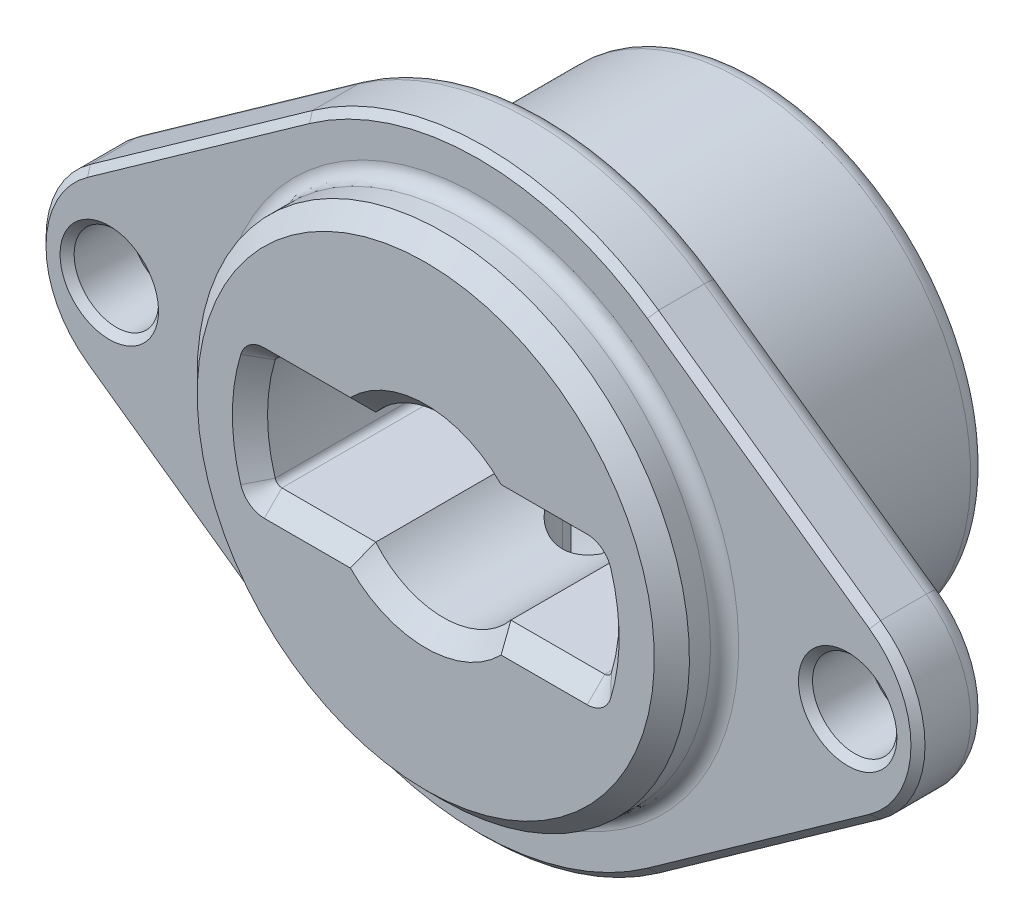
ISO-10303-21;
HEADER;
FILE_DESCRIPTION(('STEP AP214'),'2;1');
FILE_NAME('part.step','',(''),(''),'','','');
FILE_SCHEMA(('AUTOMOTIVE_DESIGN { 1 0 10303 214 1 1 1 1 }'));
ENDSEC;
DATA;
#1=APPLICATION_CONTEXT('core data for automotive mechanical design processes');
#2=APPLICATION_PROTOCOL_DEFINITION('international standard','automotive_design',2000,#1);
#3=PRODUCT_CONTEXT('',#1,'mechanical');
#4=PRODUCT('Part','Part','',(#3));
#5=PRODUCT_RELATED_PRODUCT_CATEGORY('part','',(#4));
#6=PRODUCT_DEFINITION_FORMATION('','',#4);
#7=PRODUCT_DEFINITION_CONTEXT('part definition',#1,'design');
#8=PRODUCT_DEFINITION('design','',#6,#7);
#9=PRODUCT_DEFINITION_SHAPE('','',#8);
#10=(LENGTH_UNIT() NAMED_UNIT(*) SI_UNIT(.MILLI.,.METRE.));
#11=(NAMED_UNIT(*) PLANE_ANGLE_UNIT() SI_UNIT($,.RADIAN.));
#12=(NAMED_UNIT(*) SI_UNIT($,.STERADIAN.) SOLID_ANGLE_UNIT());
#13=UNCERTAINTY_MEASURE_WITH_UNIT(LENGTH_MEASURE(1.E-05),#10,'distance_accuracy_value','');
#14=(GEOMETRIC_REPRESENTATION_CONTEXT(3) GLOBAL_UNCERTAINTY_ASSIGNED_CONTEXT((#13)) GLOBAL_UNIT_ASSIGNED_CONTEXT((#10,
#11,#12)) REPRESENTATION_CONTEXT('',''));
#15=CARTESIAN_POINT('',(0.,0.,0.));
#16=DIRECTION('',(0.,0.,1.));
#17=DIRECTION('',(1.,0.,0.));
#18=AXIS2_PLACEMENT_3D('',#15,#16,#17);
#19=CARTESIAN_POINT('',(0.,0.,0.));
#20=DIRECTION('',(0.,0.,1.));
#21=DIRECTION('',(0.,-1.,0.));
#22=AXIS2_PLACEMENT_3D('',#19,#20,#21);
#23=PLANE('',#22);
#24=CARTESIAN_POINT('',(0.,0.,0.));
#25=DIRECTION('',(0.,0.,1.));
#26=DIRECTION('',(0.,-1.,0.));
#27=AXIS2_PLACEMENT_3D('',#24,#25,#26);
#28=CIRCLE('',#27,7.4);
#29=CARTESIAN_POINT('',(0.,-7.4,0.));
#30=VERTEX_POINT('',#29);
#31=EDGE_CURVE('E741',#30,#30,#28,.F.);
#32=ORIENTED_EDGE('',*,*,#31,.T.);
#33=EDGE_LOOP('',(#32));
#34=FACE_BOUND('',#33,.T.);
#35=DIRECTION('',(0.815364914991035,-0.578947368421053,0.));
#36=VECTOR('',#35,1.);
#37=CARTESIAN_POINT('',(-4.80526315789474,-6.76752879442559,0.));
#38=LINE('',#37,#36);
#39=CARTESIAN_POINT('',(-11.1210526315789,-2.2830217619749,0.));
#40=VERTEX_POINT('',#39);
#41=CARTESIAN_POINT('',(-4.80526315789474,-6.76752879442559,0.));
#42=VERTEX_POINT('',#41);
#43=EDGE_CURVE('E805',#40,#42,#38,.T.);
#44=ORIENTED_EDGE('',*,*,#43,.T.);
#45=CARTESIAN_POINT('',(0.,0.,0.));
#46=DIRECTION('',(0.,0.,1.));
#47=DIRECTION('',(0.,-1.,0.));
#48=AXIS2_PLACEMENT_3D('',#45,#46,#47);
#49=CIRCLE('',#48,8.3);
#50=CARTESIAN_POINT('',(4.80526315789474,-6.76752879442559,0.));
#51=VERTEX_POINT('',#50);
#52=EDGE_CURVE('E800',#42,#51,#49,.T.);
#53=ORIENTED_EDGE('',*,*,#52,.T.);
#54=DIRECTION('',(0.815364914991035,0.578947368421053,0.));
#55=VECTOR('',#54,1.);
#56=CARTESIAN_POINT('',(4.80526315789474,-6.76752879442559,0.));
#57=LINE('',#56,#55);
#58=CARTESIAN_POINT('',(11.1210526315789,-2.2830217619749,0.));
#59=VERTEX_POINT('',#58);
#60=EDGE_CURVE('E803',#51,#59,#57,.T.);
#61=ORIENTED_EDGE('',*,*,#60,.T.);
#62=CARTESIAN_POINT('',(9.5,0.,0.));
#63=DIRECTION('',(0.,0.,1.));
#64=DIRECTION('',(0.,-1.,0.));
#65=AXIS2_PLACEMENT_3D('',#62,#63,#64);
#66=CIRCLE('',#65,2.8);
#67=CARTESIAN_POINT('',(11.1210526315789,2.2830217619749,0.));
#68=VERTEX_POINT('',#67);
#69=EDGE_CURVE('E807',#59,#68,#66,.T.);
#70=ORIENTED_EDGE('',*,*,#69,.T.);
#71=DIRECTION('',(-0.815364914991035,0.578947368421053,0.));
#72=VECTOR('',#71,1.);
#73=CARTESIAN_POINT('',(4.80526315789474,6.76752879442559,0.));
#74=LINE('',#73,#72);
#75=CARTESIAN_POINT('',(4.80526315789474,6.76752879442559,0.));
#76=VERTEX_POINT('',#75);
#77=EDGE_CURVE('E815',#68,#76,#74,.T.);
#78=ORIENTED_EDGE('',*,*,#77,.T.);
#79=CARTESIAN_POINT('',(0.,0.,0.));
#80=DIRECTION('',(0.,0.,1.));
#81=DIRECTION('',(0.,-1.,0.));
#82=AXIS2_PLACEMENT_3D('',#79,#80,#81);
#83=CIRCLE('',#82,8.3);
#84=CARTESIAN_POINT('',(-4.80526315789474,6.76752879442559,0.));
#85=VERTEX_POINT('',#84);
#86=EDGE_CURVE('E813',#76,#85,#83,.T.);
#87=ORIENTED_EDGE('',*,*,#86,.T.);
#88=DIRECTION('',(-0.815364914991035,-0.578947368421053,0.));
#89=VECTOR('',#88,1.);
#90=CARTESIAN_POINT('',(-4.80526315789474,6.76752879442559,0.));
#91=LINE('',#90,#89);
#92=CARTESIAN_POINT('',(-11.1210526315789,2.2830217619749,0.));
#93=VERTEX_POINT('',#92);
#94=EDGE_CURVE('E811',#85,#93,#91,.T.);
#95=ORIENTED_EDGE('',*,*,#94,.T.);
#96=CARTESIAN_POINT('',(-9.5,0.,0.));
#97=DIRECTION('',(0.,0.,1.));
#98=DIRECTION('',(0.,-1.,0.));
#99=AXIS2_PLACEMENT_3D('',#96,#97,#98);
#100=CIRCLE('',#99,2.8);
#101=EDGE_CURVE('E809',#93,#40,#100,.T.);
#102=ORIENTED_EDGE('',*,*,#101,.T.);
#103=EDGE_LOOP('',(#44,#53,#61,#70,#78,#87,#95,#102));
#104=FACE_BOUND('',#103,.T.);
#105=CARTESIAN_POINT('',(10.5,0.,0.));
#106=DIRECTION('',(0.,0.,1.));
#107=DIRECTION('',(0.,-1.,0.));
#108=AXIS2_PLACEMENT_3D('',#105,#106,#107);
#109=CIRCLE('',#108,1.4);
#110=CARTESIAN_POINT('',(10.5,-1.39999999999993,0.));
#111=VERTEX_POINT('',#110);
#112=EDGE_CURVE('E820',#111,#111,#109,.F.);
#113=ORIENTED_EDGE('',*,*,#112,.T.);
#114=EDGE_LOOP('',(#113));
#115=FACE_BOUND('',#114,.T.);
#116=CARTESIAN_POINT('',(-10.5,0.,0.));
#117=DIRECTION('',(0.,0.,1.));
#118=DIRECTION('',(0.,-1.,0.));
#119=AXIS2_PLACEMENT_3D('',#116,#117,#118);
#120=CIRCLE('',#119,1.4);
#121=CARTESIAN_POINT('',(-10.5,-1.4,0.));
#122=VERTEX_POINT('',#121);
#123=EDGE_CURVE('E823',#122,#122,#120,.F.);
#124=ORIENTED_EDGE('',*,*,#123,.T.);
#125=EDGE_LOOP('',(#124));
#126=FACE_BOUND('',#125,.T.);
#127=ADVANCED_FACE('F14',(#34,#104,#115,#126),#23,.T.);
#128=CARTESIAN_POINT('',(-10.5,0.,-2.));
#129=DIRECTION('',(0.,0.,-1.));
#130=DIRECTION('',(0.,1.,0.));
#131=AXIS2_PLACEMENT_3D('',#128,#129,#130);
#132=PLANE('',#131);
#133=DIRECTION('',(-0.815364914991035,-0.578947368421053,0.));
#134=VECTOR('',#133,1.);
#135=CARTESIAN_POINT('',(-2.34903047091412,-11.4794797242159,-2.));
#136=LINE('',#135,#134);
#137=CARTESIAN_POINT('',(10.9473684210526,-2.03841228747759,-2.));
#138=VERTEX_POINT('',#137);
#139=CARTESIAN_POINT('',(4.63157894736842,-6.52291931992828,-2.));
#140=VERTEX_POINT('',#139);
#141=EDGE_CURVE('E728',#138,#140,#136,.T.);
#142=ORIENTED_EDGE('',*,*,#141,.T.);
#143=CARTESIAN_POINT('',(0.,0.,-2.));
#144=DIRECTION('',(0.,0.,-1.));
#145=DIRECTION('',(0.,1.,0.));
#146=AXIS2_PLACEMENT_3D('',#143,#144,#145);
#147=CIRCLE('',#146,8.);
#148=CARTESIAN_POINT('',(-4.63157894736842,-6.52291931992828,-2.));
#149=VERTEX_POINT('',#148);
#150=EDGE_CURVE('E725',#140,#149,#147,.T.);
#151=ORIENTED_EDGE('',*,*,#150,.T.);
#152=DIRECTION('',(-0.815364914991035,0.578947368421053,0.));
#153=VECTOR('',#152,1.);
#154=CARTESIAN_POINT('',(-11.612188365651,-1.56635891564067,-2.));
#155=LINE('',#154,#153);
#156=CARTESIAN_POINT('',(-10.9473684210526,-2.03841228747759,-2.));
#157=VERTEX_POINT('',#156);
#158=EDGE_CURVE('E739',#149,#157,#155,.T.);
#159=ORIENTED_EDGE('',*,*,#158,.T.);
#160=CARTESIAN_POINT('',(-9.5,0.,-2.));
#161=DIRECTION('',(0.,0.,-1.));
#162=DIRECTION('',(0.,1.,0.));
#163=AXIS2_PLACEMENT_3D('',#160,#161,#162);
#164=CIRCLE('',#163,2.5);
#165=CARTESIAN_POINT('',(-10.9473684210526,2.03841228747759,-2.));
#166=VERTEX_POINT('',#165);
#167=EDGE_CURVE('E737',#157,#166,#164,.T.);
#168=ORIENTED_EDGE('',*,*,#167,.T.);
#169=DIRECTION('',(0.815364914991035,0.578947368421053,0.));
#170=VECTOR('',#169,1.);
#171=CARTESIAN_POINT('',(-11.612188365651,1.56635891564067,-2.));
#172=LINE('',#171,#170);
#173=CARTESIAN_POINT('',(-4.63157894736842,6.52291931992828,-2.));
#174=VERTEX_POINT('',#173);
#175=EDGE_CURVE('E735',#166,#174,#172,.T.);
#176=ORIENTED_EDGE('',*,*,#175,.T.);
#177=CARTESIAN_POINT('',(0.,0.,-2.));
#178=DIRECTION('',(0.,0.,-1.));
#179=DIRECTION('',(0.,1.,0.));
#180=AXIS2_PLACEMENT_3D('',#177,#178,#179);
#181=CIRCLE('',#180,8.);
#182=CARTESIAN_POINT('',(4.63157894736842,6.52291931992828,-2.));
#183=VERTEX_POINT('',#182);
#184=EDGE_CURVE('E733',#174,#183,#181,.T.);
#185=ORIENTED_EDGE('',*,*,#184,.T.);
#186=DIRECTION('',(0.815364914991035,-0.578947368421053,0.));
#187=VECTOR('',#186,1.);
#188=CARTESIAN_POINT('',(-2.34903047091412,11.4794797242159,-2.));
#189=LINE('',#188,#187);
#190=CARTESIAN_POINT('',(10.9473684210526,2.03841228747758,-2.));
#191=VERTEX_POINT('',#190);
#192=EDGE_CURVE('E690',#183,#191,#189,.T.);
#193=ORIENTED_EDGE('',*,*,#192,.T.);
#194=CARTESIAN_POINT('',(9.5,0.,-2.));
#195=DIRECTION('',(0.,0.,-1.));
#196=DIRECTION('',(0.,1.,0.));
#197=AXIS2_PLACEMENT_3D('',#194,#195,#196);
#198=CIRCLE('',#197,2.5);
#199=EDGE_CURVE('E730',#191,#138,#198,.T.);
#200=ORIENTED_EDGE('',*,*,#199,.T.);
#201=EDGE_LOOP('',(#142,#151,#159,#168,#176,#185,#193,#200));
#202=FACE_BOUND('',#201,.T.);
#203=CARTESIAN_POINT('',(0.,0.,-2.));
#204=DIRECTION('',(0.,0.,-1.));
#205=DIRECTION('',(0.,1.,0.));
#206=AXIS2_PLACEMENT_3D('',#203,#204,#205);
#207=CIRCLE('',#206,7.);
#208=CARTESIAN_POINT('',(0.,7.,-2.));
#209=VERTEX_POINT('',#208);
#210=EDGE_CURVE('E746',#209,#209,#207,.F.);
#211=ORIENTED_EDGE('',*,*,#210,.T.);
#212=EDGE_LOOP('',(#211));
#213=FACE_BOUND('',#212,.T.);
#214=CARTESIAN_POINT('',(-10.5,0.,-2.));
#215=DIRECTION('',(0.,0.,-1.));
#216=DIRECTION('',(0.,1.,0.));
#217=AXIS2_PLACEMENT_3D('',#214,#215,#216);
#218=CIRCLE('',#217,1.4);
#219=CARTESIAN_POINT('',(-10.5,1.4,-2.));
#220=VERTEX_POINT('',#219);
#221=EDGE_CURVE('E829',#220,#220,#218,.F.);
#222=ORIENTED_EDGE('',*,*,#221,.T.);
#223=EDGE_LOOP('',(#222));
#224=FACE_BOUND('',#223,.T.);
#225=CARTESIAN_POINT('',(10.5,0.,-2.));
#226=DIRECTION('',(0.,0.,-1.));
#227=DIRECTION('',(0.,1.,0.));
#228=AXIS2_PLACEMENT_3D('',#225,#226,#227);
#229=CIRCLE('',#228,1.4);
#230=CARTESIAN_POINT('',(10.5,1.40000000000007,-2.));
#231=VERTEX_POINT('',#230);
#232=EDGE_CURVE('E835',#231,#231,#229,.F.);
#233=ORIENTED_EDGE('',*,*,#232,.T.);
#234=EDGE_LOOP('',(#233));
#235=FACE_BOUND('',#234,.T.);
#236=ADVANCED_FACE('F596',(#202,#213,#224,#235),#132,.T.);
#237=CARTESIAN_POINT('',(0.,0.,1.5));
#238=DIRECTION('',(0.,0.,1.));
#239=DIRECTION('',(0.,-1.,0.));
#240=AXIS2_PLACEMENT_3D('',#237,#238,#239);
#241=PLANE('',#240);
#242=CARTESIAN_POINT('',(0.,0.,1.5));
#243=DIRECTION('',(0.,0.,1.));
#244=DIRECTION('',(0.,-1.,0.));
#245=AXIS2_PLACEMENT_3D('',#242,#243,#244);
#246=CIRCLE('',#245,6.5);
#247=CARTESIAN_POINT('',(0.,-6.5,1.5));
#248=VERTEX_POINT('',#247);
#249=EDGE_CURVE('E755',#248,#248,#246,.T.);
#250=ORIENTED_EDGE('',*,*,#249,.T.);
#251=EDGE_LOOP('',(#250));
#252=FACE_BOUND('',#251,.T.);
#253=CARTESIAN_POINT('',(0.,0.,1.5));
#254=DIRECTION('',(0.,0.,1.));
#255=DIRECTION('',(0.,-1.,0.));
#256=AXIS2_PLACEMENT_3D('',#253,#254,#255);
#257=CIRCLE('',#256,3.);
#258=CARTESIAN_POINT('',(-2.14242852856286,2.1,1.5));
#259=VERTEX_POINT('',#258);
#260=CARTESIAN_POINT('',(2.14242852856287,2.1,1.5));
#261=VERTEX_POINT('',#260);
#262=EDGE_CURVE('E517',#259,#261,#257,.F.);
#263=ORIENTED_EDGE('',*,*,#262,.T.);
#264=DIRECTION('',(1.,0.,0.));
#265=VECTOR('',#264,1.);
#266=CARTESIAN_POINT('',(4.5912961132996,2.1,1.5));
#267=LINE('',#266,#265);
#268=CARTESIAN_POINT('',(4.5912961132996,2.1,1.5));
#269=VERTEX_POINT('',#268);
#270=EDGE_CURVE('E978',#261,#269,#267,.T.);
#271=ORIENTED_EDGE('',*,*,#270,.T.);
#272=CARTESIAN_POINT('',(4.5912961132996,1.4,1.5));
#273=DIRECTION('',(0.,0.,1.));
#274=DIRECTION('',(0.,-1.,0.));
#275=AXIS2_PLACEMENT_3D('',#272,#273,#274);
#276=CIRCLE('',#275,0.7);
#277=CARTESIAN_POINT('',(5.26086012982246,1.60416666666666,1.5));
#278=VERTEX_POINT('',#277);
#279=EDGE_CURVE('E971',#269,#278,#276,.F.);
#280=ORIENTED_EDGE('',*,*,#279,.T.);
#281=CARTESIAN_POINT('',(0.,0.,1.5));
#282=DIRECTION('',(0.,0.,1.));
#283=DIRECTION('',(0.,-1.,0.));
#284=AXIS2_PLACEMENT_3D('',#281,#282,#283);
#285=CIRCLE('',#284,5.5);
#286=CARTESIAN_POINT('',(5.26086012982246,-1.60416666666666,1.5));
#287=VERTEX_POINT('',#286);
#288=EDGE_CURVE('E960',#278,#287,#285,.F.);
#289=ORIENTED_EDGE('',*,*,#288,.T.);
#290=CARTESIAN_POINT('',(4.5912961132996,-1.4,1.5));
#291=DIRECTION('',(0.,0.,1.));
#292=DIRECTION('',(0.,-1.,0.));
#293=AXIS2_PLACEMENT_3D('',#290,#291,#292);
#294=CIRCLE('',#293,0.7);
#295=CARTESIAN_POINT('',(4.5912961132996,-2.1,1.5));
#296=VERTEX_POINT('',#295);
#297=EDGE_CURVE('E965',#287,#296,#294,.F.);
#298=ORIENTED_EDGE('',*,*,#297,.T.);
#299=DIRECTION('',(-1.,0.,0.));
#300=VECTOR('',#299,1.);
#301=CARTESIAN_POINT('',(2.53771550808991,-2.1,1.5));
#302=LINE('',#301,#300);
#303=CARTESIAN_POINT('',(2.14242852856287,-2.1,1.5));
#304=VERTEX_POINT('',#303);
#305=EDGE_CURVE('E969',#296,#304,#302,.T.);
#306=ORIENTED_EDGE('',*,*,#305,.T.);
#307=CARTESIAN_POINT('',(0.,0.,1.5));
#308=DIRECTION('',(0.,0.,1.));
#309=DIRECTION('',(0.,-1.,0.));
#310=AXIS2_PLACEMENT_3D('',#307,#308,#309);
#311=CIRCLE('',#310,3.);
#312=CARTESIAN_POINT('',(-2.14242852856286,-2.1,1.5));
#313=VERTEX_POINT('',#312);
#314=EDGE_CURVE('E530',#304,#313,#311,.F.);
#315=ORIENTED_EDGE('',*,*,#314,.T.);
#316=DIRECTION('',(-1.,0.,0.));
#317=VECTOR('',#316,1.);
#318=CARTESIAN_POINT('',(-4.5912961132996,-2.1,1.5));
#319=LINE('',#318,#317);
#320=CARTESIAN_POINT('',(-4.5912961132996,-2.1,1.5));
#321=VERTEX_POINT('',#320);
#322=EDGE_CURVE('E997',#313,#321,#319,.T.);
#323=ORIENTED_EDGE('',*,*,#322,.T.);
#324=CARTESIAN_POINT('',(-4.5912961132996,-1.4,1.5));
#325=DIRECTION('',(0.,0.,1.));
#326=DIRECTION('',(0.,-1.,0.));
#327=AXIS2_PLACEMENT_3D('',#324,#325,#326);
#328=CIRCLE('',#327,0.7);
#329=CARTESIAN_POINT('',(-5.26086012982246,-1.60416666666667,1.5));
#330=VERTEX_POINT('',#329);
#331=EDGE_CURVE('E1000',#321,#330,#328,.F.);
#332=ORIENTED_EDGE('',*,*,#331,.T.);
#333=CARTESIAN_POINT('',(0.,0.,1.5));
#334=DIRECTION('',(0.,0.,1.));
#335=DIRECTION('',(0.,-1.,0.));
#336=AXIS2_PLACEMENT_3D('',#333,#334,#335);
#337=CIRCLE('',#336,5.5);
#338=CARTESIAN_POINT('',(-5.26086012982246,1.60416666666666,1.5));
#339=VERTEX_POINT('',#338);
#340=EDGE_CURVE('E1001',#330,#339,#337,.F.);
#341=ORIENTED_EDGE('',*,*,#340,.T.);
#342=CARTESIAN_POINT('',(-4.5912961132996,1.4,1.5));
#343=DIRECTION('',(0.,0.,1.));
#344=DIRECTION('',(0.,-1.,0.));
#345=AXIS2_PLACEMENT_3D('',#342,#343,#344);
#346=CIRCLE('',#345,0.7);
#347=CARTESIAN_POINT('',(-4.5912961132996,2.1,1.5));
#348=VERTEX_POINT('',#347);
#349=EDGE_CURVE('E1005',#339,#348,#346,.F.);
#350=ORIENTED_EDGE('',*,*,#349,.T.);
#351=DIRECTION('',(1.,0.,0.));
#352=VECTOR('',#351,1.);
#353=CARTESIAN_POINT('',(-2.53771550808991,2.1,1.5));
#354=LINE('',#353,#352);
#355=EDGE_CURVE('E973',#348,#259,#354,.T.);
#356=ORIENTED_EDGE('',*,*,#355,.T.);
#357=EDGE_LOOP('',(#263,#271,#280,#289,#298,#306,#315,#323,#332,#341,#350,#356));
#358=FACE_BOUND('',#357,.T.);
#359=ADVANCED_FACE('F584',(#252,#358),#241,.T.);
#360=CARTESIAN_POINT('',(0.,0.,1.5));
#361=DIRECTION('',(0.,0.,1.));
#362=DIRECTION('',(0.,-1.,0.));
#363=AXIS2_PLACEMENT_3D('',#360,#361,#362);
#364=CYLINDRICAL_SURFACE('',#363,5.);
#365=CARTESIAN_POINT('',(0.,0.,-8.));
#366=DIRECTION('',(0.,0.,1.));
#367=DIRECTION('',(0.,-1.,0.));
#368=AXIS2_PLACEMENT_3D('',#365,#366,#367);
#369=CIRCLE('',#368,5.);
#370=CARTESIAN_POINT('',(0.,-5.,-8.));
#371=VERTEX_POINT('',#370);
#372=EDGE_CURVE('E1497',#371,#371,#369,.T.);
#373=ORIENTED_EDGE('',*,*,#372,.F.);
#374=EDGE_LOOP('',(#373));
#375=FACE_BOUND('',#374,.T.);
#376=CARTESIAN_POINT('',(-1.25,-4.84122918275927,-3.635));
#377=CARTESIAN_POINT('',(-1.25000042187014,-4.84122685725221,-3.60042126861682));
#378=CARTESIAN_POINT('',(-1.24856425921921,-4.84160012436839,-3.56585967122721));
#379=CARTESIAN_POINT('',(-1.24283911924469,-4.84307380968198,-3.49699495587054));
#380=CARTESIAN_POINT('',(-1.23855062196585,-4.84417410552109,-3.46269179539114));
#381=CARTESIAN_POINT('',(-1.22146904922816,-4.84852138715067,-3.36068353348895));
#382=CARTESIAN_POINT('',(-1.20445961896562,-4.85281503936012,-3.29367941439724));
#383=CARTESIAN_POINT('',(-1.15974759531,-4.86369278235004,-3.16359415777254));
#384=CARTESIAN_POINT('',(-1.13204600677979,-4.87027665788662,-3.10051265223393));
#385=CARTESIAN_POINT('',(-1.06676922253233,-4.88498918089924,-2.97986068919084));
#386=CARTESIAN_POINT('',(-1.02919137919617,-4.89311824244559,-2.92229171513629));
#387=CARTESIAN_POINT('',(-0.944355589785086,-4.91020327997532,-2.81307014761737));
#388=CARTESIAN_POINT('',(-0.896921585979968,-4.91917238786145,-2.7615563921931));
#389=CARTESIAN_POINT('',(-0.794094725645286,-4.93681380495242,-2.66712238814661));
#390=CARTESIAN_POINT('',(-0.738700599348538,-4.94548606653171,-2.62420351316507));
#391=CARTESIAN_POINT('',(-0.620571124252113,-4.9617022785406,-2.54761124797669));
#392=CARTESIAN_POINT('',(-0.557744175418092,-4.96922880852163,-2.51407513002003));
#393=CARTESIAN_POINT('',(-0.427128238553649,-4.98215432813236,-2.45809408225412));
#394=CARTESIAN_POINT('',(-0.359340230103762,-4.98755373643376,-2.43564696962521));
#395=CARTESIAN_POINT('',(-0.222180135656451,-4.9955237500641,-2.40292625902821));
#396=CARTESIAN_POINT('',(-0.152867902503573,-4.99814941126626,-2.39241540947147));
#397=CARTESIAN_POINT('',(-0.0134159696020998,-5.00046797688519,-2.38312078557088));
#398=CARTESIAN_POINT('',(0.0567236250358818,-5.00016124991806,-2.38433553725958));
#399=CARTESIAN_POINT('',(0.19419061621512,-4.9966904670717,-2.39828745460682));
#400=CARTESIAN_POINT('',(0.261545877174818,-4.99358998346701,-2.41076827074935));
#401=CARTESIAN_POINT('',(0.393173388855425,-4.9849541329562,-2.44648584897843));
#402=CARTESIAN_POINT('',(0.457445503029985,-4.97941865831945,-2.46972308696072));
#403=CARTESIAN_POINT('',(0.581759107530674,-4.96643747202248,-2.52650160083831));
#404=CARTESIAN_POINT('',(0.641757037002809,-4.95897492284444,-2.56013424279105));
#405=CARTESIAN_POINT('',(0.755345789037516,-4.94294931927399,-2.63667891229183));
#406=CARTESIAN_POINT('',(0.808935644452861,-4.93438609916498,-2.67959233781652));
#407=CARTESIAN_POINT('',(0.909711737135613,-4.91681957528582,-2.77484864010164));
#408=CARTESIAN_POINT('',(0.956686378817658,-4.90781063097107,-2.82741454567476));
#409=CARTESIAN_POINT('',(1.0412119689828,-4.89057710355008,-2.93978733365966));
#410=CARTESIAN_POINT('',(1.07876033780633,-4.88235273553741,-2.99959619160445));
#411=CARTESIAN_POINT('',(1.14350588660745,-4.86759766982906,-3.1251819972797));
#412=CARTESIAN_POINT('',(1.17064627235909,-4.86107632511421,-3.1909893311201));
#413=CARTESIAN_POINT('',(1.21337793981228,-4.85058823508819,-3.32639616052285));
#414=CARTESIAN_POINT('',(1.22898648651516,-4.84661767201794,-3.3959898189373));
#415=CARTESIAN_POINT('',(1.24238079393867,-4.84319113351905,-3.49432172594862));
#416=CARTESIAN_POINT('',(1.24523848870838,-4.84245653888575,-3.52239962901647));
#417=CARTESIAN_POINT('',(1.24904594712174,-4.84147578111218,-3.57864723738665));
#418=CARTESIAN_POINT('',(1.24999879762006,-4.84122882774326,-3.60681671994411));
#419=CARTESIAN_POINT('',(1.25,-4.84122918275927,-3.635));
#420=B_SPLINE_CURVE_WITH_KNOTS('',3,(#376,#377,#378,#379,#380,#381,#382,#383,#384,#385,#386,
#387,#388,#389,#390,#391,#392,#393,#394,#395,#396,#397,#398,#399,#400,#401,#402,#403,#404,#405,
#406,#407,#408,#409,#410,#411,#412,#413,#414,#415,#416,#417,#418,#419),.UNSPECIFIED.,.F.,.F.,(4,
2,2,2,2,2,2,2,2,2,2,2,2,2,2,2,2,2,2,2,2,4),(0.,0.103670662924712,0.207323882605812,
0.414037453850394,0.620731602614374,0.827481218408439,1.03830237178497,1.24915719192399,
1.46295233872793,1.6767053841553,1.88613101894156,2.09553032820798,2.30028181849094,
2.50504236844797,2.7116563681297,2.91830151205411,3.13051786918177,3.34279223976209,
3.55620900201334,3.76930559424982,3.8539481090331,3.93845334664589),.UNSPECIFIED.);
#421=CARTESIAN_POINT('',(-1.25,-4.84122918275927,-3.635));
#422=VERTEX_POINT('',#421);
#423=CARTESIAN_POINT('',(0.944957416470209,-4.90989363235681,-2.8167363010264));
#424=VERTEX_POINT('',#423);
#425=EDGE_CURVE('E550',#422,#424,#420,.T.);
#426=ORIENTED_EDGE('',*,*,#425,.T.);
#427=DIRECTION('',(0.,0.,-1.));
#428=VECTOR('',#427,1.);
#429=CARTESIAN_POINT('',(0.944957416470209,-4.90989363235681,-0.884875));
#430=LINE('',#429,#428);
#431=CARTESIAN_POINT('',(0.944957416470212,-4.90989363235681,-3.884875));
#432=VERTEX_POINT('',#431);
#433=EDGE_CURVE('E39',#424,#432,#430,.T.);
#434=ORIENTED_EDGE('',*,*,#433,.T.);
#435=CARTESIAN_POINT('',(0.,0.,-3.884875));
#436=DIRECTION('',(0.,0.,-1.));
#437=DIRECTION('',(1.,0.,0.));
#438=AXIS2_PLACEMENT_3D('',#435,#436,#437);
#439=CIRCLE('',#438,5.);
#440=CARTESIAN_POINT('',(4.78260011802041,-1.45833333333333,-3.884875));
#441=VERTEX_POINT('',#440);
#442=EDGE_CURVE('E298',#441,#432,#439,.T.);
#443=ORIENTED_EDGE('',*,*,#442,.F.);
#444=DIRECTION('',(0.,0.,1.));
#445=VECTOR('',#444,1.);
#446=CARTESIAN_POINT('',(4.78260011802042,-1.45833333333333,1.5));
#447=LINE('',#446,#445);
#448=CARTESIAN_POINT('',(4.78260011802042,-1.45833333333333,1.));
#449=VERTEX_POINT('',#448);
#450=EDGE_CURVE('E32',#441,#449,#447,.T.);
#451=ORIENTED_EDGE('',*,*,#450,.T.);
#452=CARTESIAN_POINT('',(0.,0.,1.));
#453=DIRECTION('',(0.,0.,1.));
#454=DIRECTION('',(0.,-1.,0.));
#455=AXIS2_PLACEMENT_3D('',#452,#453,#454);
#456=CIRCLE('',#455,5.);
#457=CARTESIAN_POINT('',(4.78260011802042,1.45833333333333,1.));
#458=VERTEX_POINT('',#457);
#459=EDGE_CURVE('E961',#449,#458,#456,.T.);
#460=ORIENTED_EDGE('',*,*,#459,.T.);
#461=DIRECTION('',(0.,0.,1.));
#462=VECTOR('',#461,1.);
#463=CARTESIAN_POINT('',(4.78260011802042,1.45833333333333,1.5));
#464=LINE('',#463,#462);
#465=CARTESIAN_POINT('',(4.78260011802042,1.45833333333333,-3.884875));
#466=VERTEX_POINT('',#465);
#467=EDGE_CURVE('E458',#458,#466,#464,.F.);
#468=ORIENTED_EDGE('',*,*,#467,.T.);
#469=CARTESIAN_POINT('',(0.,0.,-3.884875));
#470=DIRECTION('',(0.,0.,-1.));
#471=DIRECTION('',(1.,0.,0.));
#472=AXIS2_PLACEMENT_3D('',#469,#470,#471);
#473=CIRCLE('',#472,5.);
#474=CARTESIAN_POINT('',(1.25,4.84122918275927,-3.884875));
#475=VERTEX_POINT('',#474);
#476=EDGE_CURVE('E519',#475,#466,#473,.T.);
#477=ORIENTED_EDGE('',*,*,#476,.F.);
#478=DIRECTION('',(0.,0.,1.));
#479=VECTOR('',#478,1.);
#480=CARTESIAN_POINT('',(1.25,4.84122918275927,-8.5));
#481=LINE('',#480,#479);
#482=CARTESIAN_POINT('',(1.25,4.84122918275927,-3.635));
#483=VERTEX_POINT('',#482);
#484=EDGE_CURVE('E467',#475,#483,#481,.T.);
#485=ORIENTED_EDGE('',*,*,#484,.T.);
#486=CARTESIAN_POINT('',(1.25,4.84122918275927,-3.635));
#487=CARTESIAN_POINT('',(1.25000042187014,4.84122685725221,-3.60042126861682));
#488=CARTESIAN_POINT('',(1.24856425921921,4.84160012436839,-3.56585967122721));
#489=CARTESIAN_POINT('',(1.24283911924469,4.84307380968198,-3.49699495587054));
#490=CARTESIAN_POINT('',(1.23855062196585,4.84417410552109,-3.46269179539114));
#491=CARTESIAN_POINT('',(1.22146904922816,4.84852138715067,-3.36068353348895));
#492=CARTESIAN_POINT('',(1.20445961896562,4.85281503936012,-3.29367941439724));
#493=CARTESIAN_POINT('',(1.15974759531,4.86369278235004,-3.16359415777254));
#494=CARTESIAN_POINT('',(1.13204600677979,4.87027665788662,-3.10051265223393));
#495=CARTESIAN_POINT('',(1.06676922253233,4.88498918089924,-2.97986068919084));
#496=CARTESIAN_POINT('',(1.02919137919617,4.89311824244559,-2.92229171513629));
#497=CARTESIAN_POINT('',(0.944355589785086,4.91020327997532,-2.81307014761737));
#498=CARTESIAN_POINT('',(0.896921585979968,4.91917238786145,-2.7615563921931));
#499=CARTESIAN_POINT('',(0.794094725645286,4.93681380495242,-2.66712238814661));
#500=CARTESIAN_POINT('',(0.738700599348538,4.94548606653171,-2.62420351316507));
#501=CARTESIAN_POINT('',(0.620571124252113,4.9617022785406,-2.54761124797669));
#502=CARTESIAN_POINT('',(0.557744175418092,4.96922880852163,-2.51407513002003));
#503=CARTESIAN_POINT('',(0.427128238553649,4.98215432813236,-2.45809408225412));
#504=CARTESIAN_POINT('',(0.359340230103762,4.98755373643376,-2.43564696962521));
#505=CARTESIAN_POINT('',(0.222180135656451,4.9955237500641,-2.40292625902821));
#506=CARTESIAN_POINT('',(0.152867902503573,4.99814941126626,-2.39241540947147));
#507=CARTESIAN_POINT('',(0.0134159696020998,5.00046797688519,-2.38312078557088));
#508=CARTESIAN_POINT('',(-0.0567236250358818,5.00016124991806,-2.38433553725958));
#509=CARTESIAN_POINT('',(-0.19419061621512,4.9966904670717,-2.39828745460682));
#510=CARTESIAN_POINT('',(-0.261545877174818,4.99358998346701,-2.41076827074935));
#511=CARTESIAN_POINT('',(-0.393173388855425,4.9849541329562,-2.44648584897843));
#512=CARTESIAN_POINT('',(-0.457445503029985,4.97941865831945,-2.46972308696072));
#513=CARTESIAN_POINT('',(-0.581759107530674,4.96643747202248,-2.52650160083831));
#514=CARTESIAN_POINT('',(-0.641757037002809,4.95897492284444,-2.56013424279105));
#515=CARTESIAN_POINT('',(-0.755345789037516,4.94294931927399,-2.63667891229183));
#516=CARTESIAN_POINT('',(-0.808935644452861,4.93438609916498,-2.67959233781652));
#517=CARTESIAN_POINT('',(-0.909711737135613,4.91681957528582,-2.77484864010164));
#518=CARTESIAN_POINT('',(-0.956686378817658,4.90781063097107,-2.82741454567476));
#519=CARTESIAN_POINT('',(-1.0412119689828,4.89057710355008,-2.93978733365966));
#520=CARTESIAN_POINT('',(-1.07876033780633,4.88235273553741,-2.99959619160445));
#521=CARTESIAN_POINT('',(-1.14350588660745,4.86759766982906,-3.1251819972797));
#522=CARTESIAN_POINT('',(-1.17064627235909,4.86107632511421,-3.1909893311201));
#523=CARTESIAN_POINT('',(-1.21337793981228,4.85058823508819,-3.32639616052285));
#524=CARTESIAN_POINT('',(-1.22898648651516,4.84661767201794,-3.3959898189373));
#525=CARTESIAN_POINT('',(-1.24238079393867,4.84319113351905,-3.49432172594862));
#526=CARTESIAN_POINT('',(-1.24523848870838,4.84245653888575,-3.52239962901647));
#527=CARTESIAN_POINT('',(-1.24904594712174,4.84147578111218,-3.57864723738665));
#528=CARTESIAN_POINT('',(-1.24999879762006,4.84122882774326,-3.60681671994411));
#529=CARTESIAN_POINT('',(-1.25,4.84122918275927,-3.635));
#530=B_SPLINE_CURVE_WITH_KNOTS('',3,(#486,#487,#488,#489,#490,#491,#492,#493,#494,#495,#496,
#497,#498,#499,#500,#501,#502,#503,#504,#505,#506,#507,#508,#509,#510,#511,#512,#513,#514,#515,
#516,#517,#518,#519,#520,#521,#522,#523,#524,#525,#526,#527,#528,#529),.UNSPECIFIED.,.F.,.F.,(4,
2,2,2,2,2,2,2,2,2,2,2,2,2,2,2,2,2,2,2,2,4),(0.,0.103670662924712,0.207323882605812,
0.414037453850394,0.620731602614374,0.827481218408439,1.03830237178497,1.24915719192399,
1.46295233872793,1.6767053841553,1.88613101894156,2.09553032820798,2.30028181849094,
2.50504236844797,2.7116563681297,2.91830151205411,3.13051786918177,3.34279223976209,
3.55620900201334,3.76930559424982,3.8539481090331,3.93845334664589),.UNSPECIFIED.);
#531=CARTESIAN_POINT('',(-0.944957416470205,4.90989363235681,-2.8167363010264));
#532=VERTEX_POINT('',#531);
#533=EDGE_CURVE('E465',#483,#532,#530,.T.);
#534=ORIENTED_EDGE('',*,*,#533,.T.);
#535=DIRECTION('',(0.,0.,-1.));
#536=VECTOR('',#535,1.);
#537=CARTESIAN_POINT('',(-0.944957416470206,4.90989363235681,-0.884875));
#538=LINE('',#537,#536);
#539=CARTESIAN_POINT('',(-0.944957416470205,4.90989363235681,-3.884875));
#540=VERTEX_POINT('',#539);
#541=EDGE_CURVE('E406',#532,#540,#538,.T.);
#542=ORIENTED_EDGE('',*,*,#541,.T.);
#543=CARTESIAN_POINT('',(0.,0.,-3.884875));
#544=DIRECTION('',(0.,0.,-1.));
#545=DIRECTION('',(1.,0.,0.));
#546=AXIS2_PLACEMENT_3D('',#543,#544,#545);
#547=CIRCLE('',#546,5.);
#548=CARTESIAN_POINT('',(-4.78260011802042,1.45833333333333,-3.884875));
#549=VERTEX_POINT('',#548);
#550=EDGE_CURVE('E389',#549,#540,#547,.T.);
#551=ORIENTED_EDGE('',*,*,#550,.F.);
#552=DIRECTION('',(0.,0.,1.));
#553=VECTOR('',#552,1.);
#554=CARTESIAN_POINT('',(-4.78260011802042,1.45833333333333,1.5));
#555=LINE('',#554,#553);
#556=CARTESIAN_POINT('',(-4.78260011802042,1.45833333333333,1.));
#557=VERTEX_POINT('',#556);
#558=EDGE_CURVE('E454',#549,#557,#555,.T.);
#559=ORIENTED_EDGE('',*,*,#558,.T.);
#560=CARTESIAN_POINT('',(0.,0.,1.));
#561=DIRECTION('',(0.,0.,1.));
#562=DIRECTION('',(0.,-1.,0.));
#563=AXIS2_PLACEMENT_3D('',#560,#561,#562);
#564=CIRCLE('',#563,5.);
#565=CARTESIAN_POINT('',(-4.78260011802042,-1.45833333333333,1.));
#566=VERTEX_POINT('',#565);
#567=EDGE_CURVE('E982',#557,#566,#564,.T.);
#568=ORIENTED_EDGE('',*,*,#567,.T.);
#569=DIRECTION('',(0.,0.,1.));
#570=VECTOR('',#569,1.);
#571=CARTESIAN_POINT('',(-4.78260011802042,-1.45833333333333,1.5));
#572=LINE('',#571,#570);
#573=CARTESIAN_POINT('',(-4.78260011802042,-1.45833333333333,-3.884875));
#574=VERTEX_POINT('',#573);
#575=EDGE_CURVE('E459',#566,#574,#572,.F.);
#576=ORIENTED_EDGE('',*,*,#575,.T.);
#577=CARTESIAN_POINT('',(0.,0.,-3.884875));
#578=DIRECTION('',(0.,0.,-1.));
#579=DIRECTION('',(1.,0.,0.));
#580=AXIS2_PLACEMENT_3D('',#577,#578,#579);
#581=CIRCLE('',#580,5.);
#582=CARTESIAN_POINT('',(-1.25,-4.84122918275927,-3.884875));
#583=VERTEX_POINT('',#582);
#584=EDGE_CURVE('E1509',#583,#574,#581,.T.);
#585=ORIENTED_EDGE('',*,*,#584,.F.);
#586=DIRECTION('',(0.,0.,1.));
#587=VECTOR('',#586,1.);
#588=CARTESIAN_POINT('',(-1.25,-4.84122918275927,-8.5));
#589=LINE('',#588,#587);
#590=EDGE_CURVE('E1499',#583,#422,#589,.T.);
#591=ORIENTED_EDGE('',*,*,#590,.T.);
#592=EDGE_LOOP('',(#426,#434,#443,#451,#460,#468,#477,#485,#534,#542,#551,#559,#568,#576,#585,#591));
#593=FACE_BOUND('',#592,.T.);
#594=ADVANCED_FACE('F461',(#375,#593),#364,.F.);
#595=CARTESIAN_POINT('',(0.,0.,-3.884875));
#596=DIRECTION('',(0.,0.,-1.));
#597=DIRECTION('',(1.,0.,0.));
#598=AXIS2_PLACEMENT_3D('',#595,#596,#597);
#599=PLANE('',#598);
#600=CARTESIAN_POINT('',(0.,0.,-3.884875));
#601=DIRECTION('',(0.,0.,1.));
#602=DIRECTION('',(1.,0.,0.));
#603=AXIS2_PLACEMENT_3D('',#600,#601,#602);
#604=CIRCLE('',#603,2.5);
#605=CARTESIAN_POINT('',(1.92093727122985,1.6,-3.884875));
#606=VERTEX_POINT('',#605);
#607=CARTESIAN_POINT('',(1.25,2.1650635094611,-3.884875));
#608=VERTEX_POINT('',#607);
#609=EDGE_CURVE('E524',#606,#608,#604,.T.);
#610=ORIENTED_EDGE('',*,*,#609,.T.);
#611=DIRECTION('',(0.,1.,0.));
#612=VECTOR('',#611,1.);
#613=CARTESIAN_POINT('',(1.25,0.,-3.884875));
#614=LINE('',#613,#612);
#615=EDGE_CURVE('E1487',#608,#475,#614,.T.);
#616=ORIENTED_EDGE('',*,*,#615,.T.);
#617=ORIENTED_EDGE('',*,*,#476,.T.);
#618=CARTESIAN_POINT('',(4.5912961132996,1.4,-3.884875));
#619=DIRECTION('',(0.,0.,-1.));
#620=DIRECTION('',(1.,0.,0.));
#621=AXIS2_PLACEMENT_3D('',#618,#619,#620);
#622=CIRCLE('',#621,0.2);
#623=CARTESIAN_POINT('',(4.5912961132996,1.6,-3.884875));
#624=VERTEX_POINT('',#623);
#625=EDGE_CURVE('E1528',#466,#624,#622,.F.);
#626=ORIENTED_EDGE('',*,*,#625,.T.);
#627=DIRECTION('',(-1.,0.,0.));
#628=VECTOR('',#627,1.);
#629=CARTESIAN_POINT('',(-4.73708771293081,1.6,-3.884875));
#630=LINE('',#629,#628);
#631=EDGE_CURVE('E445',#624,#606,#630,.T.);
#632=ORIENTED_EDGE('',*,*,#631,.T.);
#633=EDGE_LOOP('',(#610,#616,#617,#626,#632));
#634=FACE_BOUND('',#633,.T.);
#635=ADVANCED_FACE('F583',(#634),#599,.T.);
#636=CARTESIAN_POINT('',(0.,0.,-8.5));
#637=DIRECTION('',(0.,0.,1.));
#638=DIRECTION('',(0.,-1.,0.));
#639=AXIS2_PLACEMENT_3D('',#636,#637,#638);
#640=CYLINDRICAL_SURFACE('',#639,2.5);
#641=DIRECTION('',(0.,0.,1.));
#642=VECTOR('',#641,1.);
#643=CARTESIAN_POINT('',(-1.92093727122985,1.6,-8.5));
#644=LINE('',#643,#642);
#645=CARTESIAN_POINT('',(-1.92093727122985,1.6,1.));
#646=VERTEX_POINT('',#645);
#647=CARTESIAN_POINT('',(-1.92093727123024,1.59999999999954,-3.884875));
#648=VERTEX_POINT('',#647);
#649=EDGE_CURVE('E436',#646,#648,#644,.F.);
#650=ORIENTED_EDGE('',*,*,#649,.T.);
#651=CARTESIAN_POINT('',(0.,0.,-3.884875));
#652=DIRECTION('',(0.,0.,1.));
#653=DIRECTION('',(1.,0.,0.));
#654=AXIS2_PLACEMENT_3D('',#651,#652,#653);
#655=CIRCLE('',#654,2.5);
#656=CARTESIAN_POINT('',(-0.819377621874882,2.36191031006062,-3.884875));
#657=VERTEX_POINT('',#656);
#658=EDGE_CURVE('E401',#657,#648,#655,.T.);
#659=ORIENTED_EDGE('',*,*,#658,.F.);
#660=DIRECTION('',(0.,0.,-1.));
#661=VECTOR('',#660,1.);
#662=CARTESIAN_POINT('',(-0.819377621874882,2.36191031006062,-0.884875));
#663=LINE('',#662,#661);
#664=CARTESIAN_POINT('',(-0.819377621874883,2.36191031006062,-2.69100830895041));
#665=VERTEX_POINT('',#664);
#666=EDGE_CURVE('E397',#665,#657,#663,.T.);
#667=ORIENTED_EDGE('',*,*,#666,.F.);
#668=CARTESIAN_POINT('',(1.25,2.1650635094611,-3.635));
#669=CARTESIAN_POINT('',(1.25000243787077,2.16505700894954,-3.60225494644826));
#670=CARTESIAN_POINT('',(1.24871248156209,2.16580729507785,-3.56952849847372));
#671=CARTESIAN_POINT('',(1.24358381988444,2.16875832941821,-3.50436146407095));
#672=CARTESIAN_POINT('',(1.23974668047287,2.17095818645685,-3.47192071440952));
#673=CARTESIAN_POINT('',(1.22453317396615,2.17960088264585,-3.37576316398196));
#674=CARTESIAN_POINT('',(1.20945360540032,2.18808852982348,-3.3127739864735));
#675=CARTESIAN_POINT('',(1.1701396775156,2.20935798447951,-3.19071718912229));
#676=CARTESIAN_POINT('',(1.14592393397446,2.22213105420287,-3.13164188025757));
#677=CARTESIAN_POINT('',(1.08913344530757,2.25051005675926,-3.01830520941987));
#678=CARTESIAN_POINT('',(1.056545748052,2.26612036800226,-2.96405148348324));
#679=CARTESIAN_POINT('',(0.980828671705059,2.29996280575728,-2.85711031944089));
#680=CARTESIAN_POINT('',(0.937055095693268,2.31830494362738,-2.8049139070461));
#681=CARTESIAN_POINT('',(0.841555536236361,2.35465388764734,-2.70822974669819));
#682=CARTESIAN_POINT('',(0.789827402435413,2.37266060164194,-2.66374409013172));
#683=CARTESIAN_POINT('',(0.675612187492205,2.40776838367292,-2.58079113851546));
#684=CARTESIAN_POINT('',(0.612634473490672,2.42472619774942,-2.54293305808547));
#685=CARTESIAN_POINT('',(0.480196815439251,2.45438435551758,-2.47857416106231));
#686=CARTESIAN_POINT('',(0.410740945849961,2.4670873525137,-2.45206626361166));
#687=CARTESIAN_POINT('',(0.272556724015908,2.4860056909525,-2.41311932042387));
#688=CARTESIAN_POINT('',(0.204128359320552,2.49261839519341,-2.39981330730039));
#689=CARTESIAN_POINT('',(0.0657144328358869,2.50009478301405,-2.38479238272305));
#690=CARTESIAN_POINT('',(-0.004270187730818,2.50096185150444,-2.38307064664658));
#691=CARTESIAN_POINT('',(-0.137291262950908,2.49703725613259,-2.39093337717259));
#692=CARTESIAN_POINT('',(-0.200402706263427,2.49273111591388,-2.39954768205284));
#693=CARTESIAN_POINT('',(-0.324143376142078,2.47967789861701,-2.42610140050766));
#694=CARTESIAN_POINT('',(-0.384772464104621,2.47093057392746,-2.4440413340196));
#695=CARTESIAN_POINT('',(-0.502886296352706,2.44964487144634,-2.48885303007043));
#696=CARTESIAN_POINT('',(-0.560315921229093,2.43705570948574,-2.51584495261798));
#697=CARTESIAN_POINT('',(-0.669970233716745,2.4092207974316,-2.5778287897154));
#698=CARTESIAN_POINT('',(-0.72219297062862,2.39397405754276,-2.61282368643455));
#699=CARTESIAN_POINT('',(-0.825213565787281,2.36055607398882,-2.69361630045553));
#700=CARTESIAN_POINT('',(-0.875410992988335,2.34224462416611,-2.74012215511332));
#701=CARTESIAN_POINT('',(-0.967625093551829,2.30568157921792,-2.84073072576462));
#702=CARTESIAN_POINT('',(-1.0096344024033,2.28743005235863,-2.89484020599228));
#703=CARTESIAN_POINT('',(-1.08690857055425,2.25178956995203,-3.01334965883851));
#704=CARTESIAN_POINT('',(-1.12156774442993,2.23453109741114,-3.07818713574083));
#705=CARTESIAN_POINT('',(-1.1791819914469,2.20467498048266,-3.21377873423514));
#706=CARTESIAN_POINT('',(-1.20216510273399,2.19206619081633,-3.28451820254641));
#707=CARTESIAN_POINT('',(-1.22904514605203,2.17706007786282,-3.40238864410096));
#708=CARTESIAN_POINT('',(-1.23686948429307,2.17260571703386,-3.44839122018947));
#709=CARTESIAN_POINT('',(-1.24736007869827,2.16658814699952,-3.54124558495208));
#710=CARTESIAN_POINT('',(-1.25001722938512,2.16503004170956,-3.58809872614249));
#711=CARTESIAN_POINT('',(-1.25,2.1650635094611,-3.635));
#712=B_SPLINE_CURVE_WITH_KNOTS('',3,(#668,#669,#670,#671,#672,#673,#674,#675,#676,#677,#678,
#679,#680,#681,#682,#683,#684,#685,#686,#687,#688,#689,#690,#691,#692,#693,#694,#695,#696,#697,
#698,#699,#700,#701,#702,#703,#704,#705,#706,#707,#708,#709,#710,#711),.UNSPECIFIED.,.F.,.F.,(4,
2,2,2,2,2,2,2,2,2,2,2,2,2,2,2,2,2,2,2,2,4),(0.,0.0981657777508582,0.196271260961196,
0.391189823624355,0.585713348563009,0.780539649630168,0.991300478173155,1.2021183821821,
1.42717153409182,1.65208408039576,1.86099060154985,2.06977403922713,2.26040177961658,
2.45104014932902,2.64431649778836,2.83766498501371,3.04927493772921,3.26107434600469,
3.48646332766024,3.71130848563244,3.8515789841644,3.99209644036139),.UNSPECIFIED.);
#713=CARTESIAN_POINT('',(1.25,2.1650635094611,-3.635));
#714=VERTEX_POINT('',#713);
#715=EDGE_CURVE('E509',#714,#665,#712,.T.);
#716=ORIENTED_EDGE('',*,*,#715,.F.);
#717=DIRECTION('',(0.,0.,1.));
#718=VECTOR('',#717,1.);
#719=CARTESIAN_POINT('',(1.25,2.1650635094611,-8.5));
#720=LINE('',#719,#718);
#721=EDGE_CURVE('E516',#608,#714,#720,.T.);
#722=ORIENTED_EDGE('',*,*,#721,.F.);
#723=ORIENTED_EDGE('',*,*,#609,.F.);
#724=DIRECTION('',(0.,0.,1.));
#725=VECTOR('',#724,1.);
#726=CARTESIAN_POINT('',(1.92093727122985,1.6,-8.5));
#727=LINE('',#726,#725);
#728=CARTESIAN_POINT('',(1.92093727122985,1.6,1.));
#729=VERTEX_POINT('',#728);
#730=EDGE_CURVE('E444',#606,#729,#727,.T.);
#731=ORIENTED_EDGE('',*,*,#730,.T.);
#732=CARTESIAN_POINT('',(0.,0.,1.));
#733=DIRECTION('',(0.,0.,1.));
#734=DIRECTION('',(0.,-1.,0.));
#735=AXIS2_PLACEMENT_3D('',#732,#733,#734);
#736=CIRCLE('',#735,2.5);
#737=EDGE_CURVE('E440',#729,#646,#736,.T.);
#738=ORIENTED_EDGE('',*,*,#737,.T.);
#739=EDGE_LOOP('',(#650,#659,#667,#716,#722,#723,#731,#738));
#740=FACE_BOUND('',#739,.T.);
#741=ADVANCED_FACE('F433',(#740),#640,.F.);
#742=CARTESIAN_POINT('',(-4.73708771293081,1.6,-3.884875));
#743=DIRECTION('',(0.,1.,0.));
#744=DIRECTION('',(-1.,0.,0.));
#745=AXIS2_PLACEMENT_3D('',#742,#743,#744);
#746=PLANE('',#745);
#747=DIRECTION('',(0.,0.,-1.));
#748=VECTOR('',#747,1.);
#749=CARTESIAN_POINT('',(4.5912961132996,1.6,1.5));
#750=LINE('',#749,#748);
#751=CARTESIAN_POINT('',(4.5912961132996,1.6,1.));
#752=VERTEX_POINT('',#751);
#753=EDGE_CURVE('E540',#624,#752,#750,.F.);
#754=ORIENTED_EDGE('',*,*,#753,.T.);
#755=DIRECTION('',(-1.,0.,0.));
#756=VECTOR('',#755,1.);
#757=CARTESIAN_POINT('',(2.53771550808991,1.6,1.));
#758=LINE('',#757,#756);
#759=EDGE_CURVE('E914',#752,#729,#758,.T.);
#760=ORIENTED_EDGE('',*,*,#759,.T.);
#761=ORIENTED_EDGE('',*,*,#730,.F.);
#762=ORIENTED_EDGE('',*,*,#631,.F.);
#763=EDGE_LOOP('',(#754,#760,#761,#762));
#764=FACE_BOUND('',#763,.T.);
#765=ADVANCED_FACE('F500',(#764),#746,.F.);
#766=DIRECTION('',(-1.,1.72230995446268E-13,0.));
#767=VECTOR('',#766,1.);
#768=CARTESIAN_POINT('',(-1.92093727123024,1.59999999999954,-3.884875));
#769=LINE('',#768,#767);
#770=CARTESIAN_POINT('',(-4.5912961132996,1.6,-3.884875));
#771=VERTEX_POINT('',#770);
#772=EDGE_CURVE('E364',#648,#771,#769,.T.);
#773=ORIENTED_EDGE('',*,*,#772,.F.);
#774=ORIENTED_EDGE('',*,*,#649,.F.);
#775=DIRECTION('',(-1.,0.,0.));
#776=VECTOR('',#775,1.);
#777=CARTESIAN_POINT('',(-4.5912961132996,1.6,1.));
#778=LINE('',#777,#776);
#779=CARTESIAN_POINT('',(-4.5912961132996,1.6,1.));
#780=VERTEX_POINT('',#779);
#781=EDGE_CURVE('E871',#646,#780,#778,.T.);
#782=ORIENTED_EDGE('',*,*,#781,.T.);
#783=DIRECTION('',(0.,0.,-1.));
#784=VECTOR('',#783,1.);
#785=CARTESIAN_POINT('',(-4.5912961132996,1.6,-1.88774987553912));
#786=LINE('',#785,#784);
#787=EDGE_CURVE('E449',#780,#771,#786,.T.);
#788=ORIENTED_EDGE('',*,*,#787,.T.);
#789=EDGE_LOOP('',(#773,#774,#782,#788));
#790=FACE_BOUND('',#789,.T.);
#791=ADVANCED_FACE('F447',(#790),#746,.F.);
#792=CARTESIAN_POINT('',(0.,-10.,-3.635));
#793=DIRECTION('',(0.,1.,0.));
#794=DIRECTION('',(-1.,0.,0.));
#795=AXIS2_PLACEMENT_3D('',#792,#793,#794);
#796=CYLINDRICAL_SURFACE('',#795,1.25);
#797=DIRECTION('',(0.,1.,0.));
#798=VECTOR('',#797,1.);
#799=CARTESIAN_POINT('',(1.25,-10.,-3.635));
#800=LINE('',#799,#798);
#801=EDGE_CURVE('E1521',#714,#483,#800,.T.);
#802=ORIENTED_EDGE('',*,*,#801,.F.);
#803=ORIENTED_EDGE('',*,*,#715,.T.);
#804=CARTESIAN_POINT('',(-0.944957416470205,4.90989363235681,-2.8167363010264));
#805=CARTESIAN_POINT('',(-0.941742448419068,4.78071912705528,-2.81302057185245));
#806=CARTESIAN_POINT('',(-0.938316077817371,4.65155563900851,-2.80905360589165));
#807=CARTESIAN_POINT('',(-0.931027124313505,4.39977946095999,-2.80072899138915));
#808=CARTESIAN_POINT('',(-0.927195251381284,4.2771648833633,-2.7964011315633));
#809=CARTESIAN_POINT('',(-0.919018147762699,4.03848971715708,-2.78735684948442));
#810=CARTESIAN_POINT('',(-0.914710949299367,3.92242661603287,-2.7826732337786));
#811=CARTESIAN_POINT('',(-0.90557051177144,3.69686050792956,-2.77291317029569));
#812=CARTESIAN_POINT('',(-0.900780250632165,3.58735418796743,-2.76787342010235));
#813=CARTESIAN_POINT('',(-0.890672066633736,3.37493457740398,-2.75739652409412));
#814=CARTESIAN_POINT('',(-0.885402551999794,3.27201699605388,-2.75200091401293));
#815=CARTESIAN_POINT('',(-0.874120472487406,3.07279614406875,-2.74080606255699));
#816=CARTESIAN_POINT('',(-0.868176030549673,2.97648644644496,-2.735053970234));
#817=CARTESIAN_POINT('',(-0.855487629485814,2.79048479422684,-2.72314458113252));
#818=CARTESIAN_POINT('',(-0.848824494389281,2.70078404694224,-2.71704067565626));
#819=CARTESIAN_POINT('',(-0.834722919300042,2.52800146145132,-2.70440598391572));
#820=CARTESIAN_POINT('',(-0.827374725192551,2.44490764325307,-2.69793748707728));
#821=CARTESIAN_POINT('',(-0.819377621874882,2.36191031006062,-2.69100830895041));
#822=B_SPLINE_CURVE_WITH_KNOTS('',3,(#804,#805,#806,#807,#808,#809,#810,#811,#812,#813,#814,
#815,#816,#817,#818,#819,#820,#821),.UNSPECIFIED.,.F.,.F.,(4,2,2,2,2,2,2,2,4),(0.,
0.387805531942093,0.756055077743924,1.10476316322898,1.43393935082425,1.74351347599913,
2.03349737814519,2.30394861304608,2.55494572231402),.UNSPECIFIED.);
#823=EDGE_CURVE('E430',#665,#532,#822,.F.);
#824=ORIENTED_EDGE('',*,*,#823,.T.);
#825=ORIENTED_EDGE('',*,*,#533,.F.);
#826=EDGE_LOOP('',(#802,#803,#824,#825));
#827=FACE_BOUND('',#826,.T.);
#828=ADVANCED_FACE('F493',(#827),#796,.F.);
#829=CARTESIAN_POINT('',(1.25,-10.,-6.07104329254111));
#830=DIRECTION('',(-1.,0.,0.));
#831=DIRECTION('',(0.,-1.,0.));
#832=AXIS2_PLACEMENT_3D('',#829,#830,#831);
#833=PLANE('',#832);
#834=ORIENTED_EDGE('',*,*,#615,.F.);
#835=ORIENTED_EDGE('',*,*,#721,.T.);
#836=ORIENTED_EDGE('',*,*,#801,.T.);
#837=ORIENTED_EDGE('',*,*,#484,.F.);
#838=EDGE_LOOP('',(#834,#835,#836,#837));
#839=FACE_BOUND('',#838,.T.);
#840=ADVANCED_FACE('F498',(#839),#833,.T.);
#841=CARTESIAN_POINT('',(7.,0.,-8.));
#842=DIRECTION('',(0.,0.,1.));
#843=DIRECTION('',(0.,-1.,0.));
#844=AXIS2_PLACEMENT_3D('',#841,#842,#843);
#845=PLANE('',#844);
#846=CARTESIAN_POINT('',(0.,0.,-8.));
#847=DIRECTION('',(0.,0.,1.));
#848=DIRECTION('',(0.,-1.,0.));
#849=AXIS2_PLACEMENT_3D('',#846,#847,#848);
#850=CIRCLE('',#849,6.);
#851=CARTESIAN_POINT('',(0.,-6.,-8.));
#852=VERTEX_POINT('',#851);
#853=EDGE_CURVE('E712',#852,#852,#850,.F.);
#854=ORIENTED_EDGE('',*,*,#853,.T.);
#855=EDGE_LOOP('',(#854));
#856=FACE_BOUND('',#855,.T.);
#857=ORIENTED_EDGE('',*,*,#372,.T.);
#858=EDGE_LOOP('',(#857));
#859=FACE_BOUND('',#858,.T.);
#860=ADVANCED_FACE('F581',(#856,#859),#845,.F.);
#861=CARTESIAN_POINT('',(0.,0.,-8.5));
#862=DIRECTION('',(0.,0.,1.));
#863=DIRECTION('',(0.,-1.,0.));
#864=AXIS2_PLACEMENT_3D('',#861,#862,#863);
#865=CYLINDRICAL_SURFACE('',#864,2.5);
#866=DIRECTION('',(0.,0.,-1.));
#867=VECTOR('',#866,1.);
#868=CARTESIAN_POINT('',(0.819377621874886,-2.36191031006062,-0.884875));
#869=LINE('',#868,#867);
#870=CARTESIAN_POINT('',(0.819377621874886,-2.36191031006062,-2.69100830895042));
#871=VERTEX_POINT('',#870);
#872=CARTESIAN_POINT('',(0.819377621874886,-2.36191031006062,-3.884875));
#873=VERTEX_POINT('',#872);
#874=EDGE_CURVE('E287',#871,#873,#869,.T.);
#875=ORIENTED_EDGE('',*,*,#874,.F.);
#876=CARTESIAN_POINT('',(-1.25,-2.1650635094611,-3.635));
#877=CARTESIAN_POINT('',(-1.25000243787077,-2.16505700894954,-3.60225494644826));
#878=CARTESIAN_POINT('',(-1.24871248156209,-2.16580729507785,-3.56952849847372));
#879=CARTESIAN_POINT('',(-1.24358381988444,-2.16875832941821,-3.50436146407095));
#880=CARTESIAN_POINT('',(-1.23974668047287,-2.17095818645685,-3.47192071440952));
#881=CARTESIAN_POINT('',(-1.22453317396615,-2.17960088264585,-3.37576316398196));
#882=CARTESIAN_POINT('',(-1.20945360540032,-2.18808852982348,-3.3127739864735));
#883=CARTESIAN_POINT('',(-1.1701396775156,-2.20935798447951,-3.19071718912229));
#884=CARTESIAN_POINT('',(-1.14592393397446,-2.22213105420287,-3.13164188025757));
#885=CARTESIAN_POINT('',(-1.08913344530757,-2.25051005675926,-3.01830520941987));
#886=CARTESIAN_POINT('',(-1.056545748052,-2.26612036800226,-2.96405148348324));
#887=CARTESIAN_POINT('',(-0.980828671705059,-2.29996280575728,-2.85711031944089));
#888=CARTESIAN_POINT('',(-0.937055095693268,-2.31830494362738,-2.8049139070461));
#889=CARTESIAN_POINT('',(-0.841555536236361,-2.35465388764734,-2.70822974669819));
#890=CARTESIAN_POINT('',(-0.789827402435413,-2.37266060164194,-2.66374409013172));
#891=CARTESIAN_POINT('',(-0.675612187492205,-2.40776838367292,-2.58079113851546));
#892=CARTESIAN_POINT('',(-0.612634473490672,-2.42472619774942,-2.54293305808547));
#893=CARTESIAN_POINT('',(-0.480196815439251,-2.45438435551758,-2.47857416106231));
#894=CARTESIAN_POINT('',(-0.410740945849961,-2.4670873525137,-2.45206626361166));
#895=CARTESIAN_POINT('',(-0.272556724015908,-2.4860056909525,-2.41311932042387));
#896=CARTESIAN_POINT('',(-0.204128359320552,-2.49261839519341,-2.39981330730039));
#897=CARTESIAN_POINT('',(-0.0657144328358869,-2.50009478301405,-2.38479238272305));
#898=CARTESIAN_POINT('',(0.004270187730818,-2.50096185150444,-2.38307064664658));
#899=CARTESIAN_POINT('',(0.137291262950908,-2.49703725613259,-2.39093337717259));
#900=CARTESIAN_POINT('',(0.200402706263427,-2.49273111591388,-2.39954768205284));
#901=CARTESIAN_POINT('',(0.324143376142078,-2.47967789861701,-2.42610140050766));
#902=CARTESIAN_POINT('',(0.384772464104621,-2.47093057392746,-2.4440413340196));
#903=CARTESIAN_POINT('',(0.502886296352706,-2.44964487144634,-2.48885303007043));
#904=CARTESIAN_POINT('',(0.560315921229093,-2.43705570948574,-2.51584495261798));
#905=CARTESIAN_POINT('',(0.669970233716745,-2.4092207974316,-2.5778287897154));
#906=CARTESIAN_POINT('',(0.72219297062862,-2.39397405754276,-2.61282368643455));
#907=CARTESIAN_POINT('',(0.825213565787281,-2.36055607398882,-2.69361630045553));
#908=CARTESIAN_POINT('',(0.875410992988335,-2.34224462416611,-2.74012215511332));
#909=CARTESIAN_POINT('',(0.967625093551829,-2.30568157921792,-2.84073072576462));
#910=CARTESIAN_POINT('',(1.0096344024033,-2.28743005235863,-2.89484020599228));
#911=CARTESIAN_POINT('',(1.08690857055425,-2.25178956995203,-3.01334965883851));
#912=CARTESIAN_POINT('',(1.12156774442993,-2.23453109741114,-3.07818713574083));
#913=CARTESIAN_POINT('',(1.1791819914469,-2.20467498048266,-3.21377873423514));
#914=CARTESIAN_POINT('',(1.20216510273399,-2.19206619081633,-3.28451820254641));
#915=CARTESIAN_POINT('',(1.22904514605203,-2.17706007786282,-3.40238864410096));
#916=CARTESIAN_POINT('',(1.23686948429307,-2.17260571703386,-3.44839122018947));
#917=CARTESIAN_POINT('',(1.24736007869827,-2.16658814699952,-3.54124558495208));
#918=CARTESIAN_POINT('',(1.25001722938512,-2.16503004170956,-3.58809872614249));
#919=CARTESIAN_POINT('',(1.25,-2.1650635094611,-3.635));
#920=B_SPLINE_CURVE_WITH_KNOTS('',3,(#876,#877,#878,#879,#880,#881,#882,#883,#884,#885,#886,
#887,#888,#889,#890,#891,#892,#893,#894,#895,#896,#897,#898,#899,#900,#901,#902,#903,#904,#905,
#906,#907,#908,#909,#910,#911,#912,#913,#914,#915,#916,#917,#918,#919),.UNSPECIFIED.,.F.,.F.,(4,
2,2,2,2,2,2,2,2,2,2,2,2,2,2,2,2,2,2,2,2,4),(0.,0.0981657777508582,0.196271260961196,
0.391189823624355,0.585713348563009,0.780539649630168,0.991300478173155,1.2021183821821,
1.42717153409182,1.65208408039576,1.86099060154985,2.06977403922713,2.26040177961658,
2.45104014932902,2.64431649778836,2.83766498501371,3.04927493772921,3.26107434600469,
3.48646332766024,3.71130848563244,3.8515789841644,3.99209644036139),.UNSPECIFIED.);
#921=CARTESIAN_POINT('',(-1.25,-2.1650635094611,-3.635));
#922=VERTEX_POINT('',#921);
#923=EDGE_CURVE('E577',#922,#871,#920,.T.);
#924=ORIENTED_EDGE('',*,*,#923,.F.);
#925=DIRECTION('',(0.,0.,1.));
#926=VECTOR('',#925,1.);
#927=CARTESIAN_POINT('',(-1.25,-2.1650635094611,-8.5));
#928=LINE('',#927,#926);
#929=CARTESIAN_POINT('',(-1.25,-2.1650635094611,-3.884875));
#930=VERTEX_POINT('',#929);
#931=EDGE_CURVE('E1500',#930,#922,#928,.T.);
#932=ORIENTED_EDGE('',*,*,#931,.F.);
#933=CARTESIAN_POINT('',(0.,0.,-3.884875));
#934=DIRECTION('',(0.,0.,1.));
#935=DIRECTION('',(1.,0.,0.));
#936=AXIS2_PLACEMENT_3D('',#933,#934,#935);
#937=CIRCLE('',#936,2.5);
#938=CARTESIAN_POINT('',(-1.92093727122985,-1.6,-3.884875));
#939=VERTEX_POINT('',#938);
#940=EDGE_CURVE('E1506',#939,#930,#937,.T.);
#941=ORIENTED_EDGE('',*,*,#940,.F.);
#942=DIRECTION('',(0.,0.,1.));
#943=VECTOR('',#942,1.);
#944=CARTESIAN_POINT('',(-1.92093727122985,-1.6,-8.5));
#945=LINE('',#944,#943);
#946=CARTESIAN_POINT('',(-1.92093727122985,-1.6,1.));
#947=VERTEX_POINT('',#946);
#948=EDGE_CURVE('E1512',#939,#947,#945,.T.);
#949=ORIENTED_EDGE('',*,*,#948,.T.);
#950=CARTESIAN_POINT('',(0.,0.,1.));
#951=DIRECTION('',(0.,0.,1.));
#952=DIRECTION('',(0.,-1.,0.));
#953=AXIS2_PLACEMENT_3D('',#950,#951,#952);
#954=CIRCLE('',#953,2.5);
#955=CARTESIAN_POINT('',(1.92093727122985,-1.6,1.));
#956=VERTEX_POINT('',#955);
#957=EDGE_CURVE('E515',#947,#956,#954,.T.);
#958=ORIENTED_EDGE('',*,*,#957,.T.);
#959=DIRECTION('',(0.,0.,1.));
#960=VECTOR('',#959,1.);
#961=CARTESIAN_POINT('',(1.92093727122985,-1.6,-8.5));
#962=LINE('',#961,#960);
#963=CARTESIAN_POINT('',(1.92093727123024,-1.59999999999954,-3.884875));
#964=VERTEX_POINT('',#963);
#965=EDGE_CURVE('E18',#956,#964,#962,.F.);
#966=ORIENTED_EDGE('',*,*,#965,.T.);
#967=CARTESIAN_POINT('',(0.,0.,-3.884875));
#968=DIRECTION('',(0.,0.,1.));
#969=DIRECTION('',(1.,0.,0.));
#970=AXIS2_PLACEMENT_3D('',#967,#968,#969);
#971=CIRCLE('',#970,2.5);
#972=EDGE_CURVE('E301',#873,#964,#971,.T.);
#973=ORIENTED_EDGE('',*,*,#972,.F.);
#974=EDGE_LOOP('',(#875,#924,#932,#941,#949,#958,#966,#973));
#975=FACE_BOUND('',#974,.T.);
#976=ADVANCED_FACE('F302',(#975),#865,.F.);
#977=CARTESIAN_POINT('',(0.,0.,-3.884875));
#978=DIRECTION('',(0.,0.,-1.));
#979=DIRECTION('',(1.,0.,0.));
#980=AXIS2_PLACEMENT_3D('',#977,#978,#979);
#981=PLANE('',#980);
#982=ORIENTED_EDGE('',*,*,#940,.T.);
#983=DIRECTION('',(0.,-1.,0.));
#984=VECTOR('',#983,1.);
#985=CARTESIAN_POINT('',(-1.25,0.,-3.884875));
#986=LINE('',#985,#984);
#987=EDGE_CURVE('E1498',#930,#583,#986,.T.);
#988=ORIENTED_EDGE('',*,*,#987,.T.);
#989=ORIENTED_EDGE('',*,*,#584,.T.);
#990=CARTESIAN_POINT('',(-4.5912961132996,-1.4,-3.884875));
#991=DIRECTION('',(0.,0.,-1.));
#992=DIRECTION('',(1.,0.,0.));
#993=AXIS2_PLACEMENT_3D('',#990,#991,#992);
#994=CIRCLE('',#993,0.2);
#995=CARTESIAN_POINT('',(-4.5912961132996,-1.6,-3.884875));
#996=VERTEX_POINT('',#995);
#997=EDGE_CURVE('E1025',#574,#996,#994,.F.);
#998=ORIENTED_EDGE('',*,*,#997,.T.);
#999=DIRECTION('',(1.,0.,0.));
#1000=VECTOR('',#999,1.);
#1001=CARTESIAN_POINT('',(-4.73708771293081,-1.6,-3.884875));
#1002=LINE('',#1001,#1000);
#1003=EDGE_CURVE('E1510',#996,#939,#1002,.T.);
#1004=ORIENTED_EDGE('',*,*,#1003,.T.);
#1005=EDGE_LOOP('',(#982,#988,#989,#998,#1004));
#1006=FACE_BOUND('',#1005,.T.);
#1007=ADVANCED_FACE('F564',(#1006),#981,.T.);
#1008=CARTESIAN_POINT('',(-4.73708771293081,-1.6,-3.884875));
#1009=DIRECTION('',(0.,-1.,0.));
#1010=DIRECTION('',(1.,0.,0.));
#1011=AXIS2_PLACEMENT_3D('',#1008,#1009,#1010);
#1012=PLANE('',#1011);
#1013=DIRECTION('',(0.,0.,-1.));
#1014=VECTOR('',#1013,1.);
#1015=CARTESIAN_POINT('',(-4.5912961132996,-1.6,1.5));
#1016=LINE('',#1015,#1014);
#1017=CARTESIAN_POINT('',(-4.5912961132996,-1.6,1.));
#1018=VERTEX_POINT('',#1017);
#1019=EDGE_CURVE('E1527',#996,#1018,#1016,.F.);
#1020=ORIENTED_EDGE('',*,*,#1019,.T.);
#1021=DIRECTION('',(1.,0.,0.));
#1022=VECTOR('',#1021,1.);
#1023=CARTESIAN_POINT('',(-2.53771550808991,-1.6,1.));
#1024=LINE('',#1023,#1022);
#1025=EDGE_CURVE('E841',#1018,#947,#1024,.T.);
#1026=ORIENTED_EDGE('',*,*,#1025,.T.);
#1027=ORIENTED_EDGE('',*,*,#948,.F.);
#1028=ORIENTED_EDGE('',*,*,#1003,.F.);
#1029=EDGE_LOOP('',(#1020,#1026,#1027,#1028));
#1030=FACE_BOUND('',#1029,.T.);
#1031=ADVANCED_FACE('F1399',(#1030),#1012,.F.);
#1032=DIRECTION('',(1.,-1.72230995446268E-13,0.));
#1033=VECTOR('',#1032,1.);
#1034=CARTESIAN_POINT('',(1.92093727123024,-1.59999999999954,-3.884875));
#1035=LINE('',#1034,#1033);
#1036=CARTESIAN_POINT('',(4.5912961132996,-1.6,-3.884875));
#1037=VERTEX_POINT('',#1036);
#1038=EDGE_CURVE('E308',#964,#1037,#1035,.T.);
#1039=ORIENTED_EDGE('',*,*,#1038,.F.);
#1040=ORIENTED_EDGE('',*,*,#965,.F.);
#1041=DIRECTION('',(1.,0.,0.));
#1042=VECTOR('',#1041,1.);
#1043=CARTESIAN_POINT('',(4.5912961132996,-1.6,1.));
#1044=LINE('',#1043,#1042);
#1045=CARTESIAN_POINT('',(4.5912961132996,-1.6,1.));
#1046=VERTEX_POINT('',#1045);
#1047=EDGE_CURVE('E985',#956,#1046,#1044,.T.);
#1048=ORIENTED_EDGE('',*,*,#1047,.T.);
#1049=DIRECTION('',(0.,0.,-1.));
#1050=VECTOR('',#1049,1.);
#1051=CARTESIAN_POINT('',(4.5912961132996,-1.6,-1.88774987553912));
#1052=LINE('',#1051,#1050);
#1053=EDGE_CURVE('E537',#1046,#1037,#1052,.T.);
#1054=ORIENTED_EDGE('',*,*,#1053,.T.);
#1055=EDGE_LOOP('',(#1039,#1040,#1048,#1054));
#1056=FACE_BOUND('',#1055,.T.);
#1057=ADVANCED_FACE('F561',(#1056),#1012,.F.);
#1058=CARTESIAN_POINT('',(0.,-10.,-3.635));
#1059=DIRECTION('',(0.,1.,0.));
#1060=DIRECTION('',(-1.,0.,0.));
#1061=AXIS2_PLACEMENT_3D('',#1058,#1059,#1060);
#1062=CYLINDRICAL_SURFACE('',#1061,1.25);
#1063=ORIENTED_EDGE('',*,*,#923,.T.);
#1064=CARTESIAN_POINT('',(0.944957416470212,-4.90989363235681,-2.81673630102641));
#1065=CARTESIAN_POINT('',(0.941739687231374,-4.78061046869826,-2.81301741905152));
#1066=CARTESIAN_POINT('',(0.938310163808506,-4.6513383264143,-2.80904730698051));
#1067=CARTESIAN_POINT('',(0.931015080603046,-4.39939062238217,-2.80071708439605));
#1068=CARTESIAN_POINT('',(0.927180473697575,-4.2767131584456,-2.79638698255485));
#1069=CARTESIAN_POINT('',(0.918998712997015,-4.03795947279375,-2.78733900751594));
#1070=CARTESIAN_POINT('',(0.914689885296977,-3.92188071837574,-2.7826542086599));
#1071=CARTESIAN_POINT('',(0.905547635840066,-3.69632613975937,-2.77289187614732));
#1072=CARTESIAN_POINT('',(0.900757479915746,-3.58684697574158,-2.76785136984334));
#1073=CARTESIAN_POINT('',(0.890650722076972,-3.37449188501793,-2.75737412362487));
#1074=CARTESIAN_POINT('',(0.885382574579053,-3.27161166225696,-2.75197896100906));
#1075=CARTESIAN_POINT('',(0.874103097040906,-3.07246745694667,-2.74078595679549));
#1076=CARTESIAN_POINT('',(0.868159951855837,-2.97619704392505,-2.73503524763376));
#1077=CARTESIAN_POINT('',(0.855474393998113,-2.79027517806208,-2.72312963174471));
#1078=CARTESIAN_POINT('',(0.848812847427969,-2.7006149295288,-2.71702808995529));
#1079=CARTESIAN_POINT('',(0.834715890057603,-2.52791575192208,-2.70439905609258));
#1080=CARTESIAN_POINT('',(0.827370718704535,-2.4448648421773,-2.69793385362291));
#1081=CARTESIAN_POINT('',(0.819377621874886,-2.36191031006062,-2.69100830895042));
#1082=B_SPLINE_CURVE_WITH_KNOTS('',3,(#1064,#1065,#1066,#1067,#1068,#1069,#1070,#1071,#1072,
#1073,#1074,#1075,#1076,#1077,#1078,#1079,#1080,#1081),.UNSPECIFIED.,.F.,.F.,(4,2,2,2,2,2,2,2,
4),(0.,0.388131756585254,0.756570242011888,1.10532553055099,1.43442050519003,1.74388258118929,
2.03374857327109,2.304078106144,2.55494582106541),.UNSPECIFIED.);
#1083=EDGE_CURVE('E294',#871,#424,#1082,.F.);
#1084=ORIENTED_EDGE('',*,*,#1083,.T.);
#1085=ORIENTED_EDGE('',*,*,#425,.F.);
#1086=DIRECTION('',(0.,1.,0.));
#1087=VECTOR('',#1086,1.);
#1088=CARTESIAN_POINT('',(-1.25,-10.,-3.635));
#1089=LINE('',#1088,#1087);
#1090=EDGE_CURVE('E858',#422,#922,#1089,.T.);
#1091=ORIENTED_EDGE('',*,*,#1090,.T.);
#1092=EDGE_LOOP('',(#1063,#1084,#1085,#1091));
#1093=FACE_BOUND('',#1092,.T.);
#1094=ADVANCED_FACE('F555',(#1093),#1062,.F.);
#1095=CARTESIAN_POINT('',(-1.25,-10.,-3.635));
#1096=DIRECTION('',(1.,0.,0.));
#1097=DIRECTION('',(0.,1.,0.));
#1098=AXIS2_PLACEMENT_3D('',#1095,#1096,#1097);
#1099=PLANE('',#1098);
#1100=ORIENTED_EDGE('',*,*,#931,.T.);
#1101=ORIENTED_EDGE('',*,*,#1090,.F.);
#1102=ORIENTED_EDGE('',*,*,#590,.F.);
#1103=ORIENTED_EDGE('',*,*,#987,.F.);
#1104=EDGE_LOOP('',(#1100,#1101,#1102,#1103));
#1105=FACE_BOUND('',#1104,.T.);
#1106=ADVANCED_FACE('F560',(#1105),#1099,.T.);
#1107=CARTESIAN_POINT('',(0.,0.,1.));
#1108=DIRECTION('',(0.,0.,1.));
#1109=DIRECTION('',(0.,-1.,0.));
#1110=AXIS2_PLACEMENT_3D('',#1107,#1108,#1109);
#1111=CONICAL_SURFACE('',#1110,2.5,0.78539816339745);
#1112=ORIENTED_EDGE('',*,*,#314,.F.);
#1113=CARTESIAN_POINT('',(2.14242852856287,-2.1,1.5));
#1114=CARTESIAN_POINT('',(2.12484409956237,-2.05814213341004,1.45814213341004));
#1115=CARTESIAN_POINT('',(2.10706179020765,-2.01632566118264,1.41632566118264));
#1116=CARTESIAN_POINT('',(2.07107243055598,-1.93278699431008,1.33278699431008));
#1117=CARTESIAN_POINT('',(2.05286540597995,-1.89106479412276,1.29106479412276));
#1118=CARTESIAN_POINT('',(2.01599527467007,-1.80772054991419,1.20772054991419));
#1119=CARTESIAN_POINT('',(1.99733216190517,-1.76609850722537,1.16609850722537));
#1120=CARTESIAN_POINT('',(1.95951308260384,-1.68296379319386,1.08296379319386));
#1121=CARTESIAN_POINT('',(1.94035708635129,-1.64145112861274,1.04145112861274));
#1122=CARTESIAN_POINT('',(1.92093727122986,-1.6,1.));
#1123=B_SPLINE_CURVE_WITH_KNOTS('',3,(#1113,#1114,#1115,#1116,#1117,#1118,#1119,#1120,#1121,
#1122),.UNSPECIFIED.,.F.,.F.,(4,2,2,2,4),(0.,0.18525755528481,0.370503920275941,
0.55575273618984,0.741012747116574),.UNSPECIFIED.);
#1124=EDGE_CURVE('E873',#304,#956,#1123,.T.);
#1125=ORIENTED_EDGE('',*,*,#1124,.T.);
#1126=ORIENTED_EDGE('',*,*,#957,.F.);
#1127=CARTESIAN_POINT('',(-1.92093727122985,-1.6,1.));
#1128=CARTESIAN_POINT('',(-1.94035708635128,-1.64145112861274,1.04145112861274));
#1129=CARTESIAN_POINT('',(-1.95951308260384,-1.68296379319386,1.08296379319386));
#1130=CARTESIAN_POINT('',(-1.99733216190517,-1.76609850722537,1.16609850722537));
#1131=CARTESIAN_POINT('',(-2.01599527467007,-1.80772054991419,1.20772054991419));
#1132=CARTESIAN_POINT('',(-2.05286540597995,-1.89106479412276,1.29106479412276));
#1133=CARTESIAN_POINT('',(-2.07107243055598,-1.93278699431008,1.33278699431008));
#1134=CARTESIAN_POINT('',(-2.10706179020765,-2.01632566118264,1.41632566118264));
#1135=CARTESIAN_POINT('',(-2.12484409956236,-2.05814213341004,1.45814213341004));
#1136=CARTESIAN_POINT('',(-2.14242852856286,-2.1,1.5));
#1137=B_SPLINE_CURVE_WITH_KNOTS('',3,(#1127,#1128,#1129,#1130,#1131,#1132,#1133,#1134,#1135,
#1136),.UNSPECIFIED.,.F.,.F.,(4,2,2,2,4),(0.,0.185260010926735,0.370508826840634,
0.555755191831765,0.741012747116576),.UNSPECIFIED.);
#1138=EDGE_CURVE('E880',#947,#313,#1137,.T.);
#1139=ORIENTED_EDGE('',*,*,#1138,.T.);
#1140=EDGE_LOOP('',(#1112,#1125,#1126,#1139));
#1141=FACE_BOUND('',#1140,.T.);
#1142=ADVANCED_FACE('F887',(#1141),#1111,.F.);
#1143=CARTESIAN_POINT('',(0.,0.,1.));
#1144=DIRECTION('',(0.,0.,1.));
#1145=DIRECTION('',(0.,-1.,0.));
#1146=AXIS2_PLACEMENT_3D('',#1143,#1144,#1145);
#1147=CONICAL_SURFACE('',#1146,2.5,0.78539816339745);
#1148=ORIENTED_EDGE('',*,*,#737,.F.);
#1149=CARTESIAN_POINT('',(1.92093727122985,1.6,1.));
#1150=CARTESIAN_POINT('',(1.94035708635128,1.64145112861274,1.04145112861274));
#1151=CARTESIAN_POINT('',(1.95951308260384,1.68296379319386,1.08296379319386));
#1152=CARTESIAN_POINT('',(1.99733216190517,1.76609850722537,1.16609850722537));
#1153=CARTESIAN_POINT('',(2.01599527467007,1.80772054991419,1.20772054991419));
#1154=CARTESIAN_POINT('',(2.05286540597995,1.89106479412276,1.29106479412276));
#1155=CARTESIAN_POINT('',(2.07107243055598,1.93278699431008,1.33278699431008));
#1156=CARTESIAN_POINT('',(2.10706179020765,2.01632566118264,1.41632566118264));
#1157=CARTESIAN_POINT('',(2.12484409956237,2.05814213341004,1.45814213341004));
#1158=CARTESIAN_POINT('',(2.14242852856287,2.1,1.5));
#1159=B_SPLINE_CURVE_WITH_KNOTS('',3,(#1149,#1150,#1151,#1152,#1153,#1154,#1155,#1156,#1157,
#1158),.UNSPECIFIED.,.F.,.F.,(4,2,2,2,4),(0.,0.185260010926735,0.370508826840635,
0.555755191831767,0.741012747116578),.UNSPECIFIED.);
#1160=EDGE_CURVE('E913',#729,#261,#1159,.T.);
#1161=ORIENTED_EDGE('',*,*,#1160,.T.);
#1162=ORIENTED_EDGE('',*,*,#262,.F.);
#1163=CARTESIAN_POINT('',(-2.14242852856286,2.1,1.5));
#1164=CARTESIAN_POINT('',(-2.12484409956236,2.05814213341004,1.45814213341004));
#1165=CARTESIAN_POINT('',(-2.10706179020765,2.01632566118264,1.41632566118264));
#1166=CARTESIAN_POINT('',(-2.07107243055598,1.93278699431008,1.33278699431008));
#1167=CARTESIAN_POINT('',(-2.05286540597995,1.89106479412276,1.29106479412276));
#1168=CARTESIAN_POINT('',(-2.01599527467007,1.80772054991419,1.20772054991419));
#1169=CARTESIAN_POINT('',(-1.99733216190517,1.76609850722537,1.16609850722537));
#1170=CARTESIAN_POINT('',(-1.95951308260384,1.68296379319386,1.08296379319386));
#1171=CARTESIAN_POINT('',(-1.94035708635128,1.64145112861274,1.04145112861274));
#1172=CARTESIAN_POINT('',(-1.92093727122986,1.6,1.));
#1173=B_SPLINE_CURVE_WITH_KNOTS('',3,(#1163,#1164,#1165,#1166,#1167,#1168,#1169,#1170,#1171,
#1172),.UNSPECIFIED.,.F.,.F.,(4,2,2,2,4),(0.,0.185257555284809,0.370503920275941,
0.55575273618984,0.741012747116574),.UNSPECIFIED.);
#1174=EDGE_CURVE('E906',#259,#646,#1173,.T.);
#1175=ORIENTED_EDGE('',*,*,#1174,.T.);
#1176=EDGE_LOOP('',(#1148,#1161,#1162,#1175));
#1177=FACE_BOUND('',#1176,.T.);
#1178=ADVANCED_FACE('F922',(#1177),#1147,.F.);
#1179=CARTESIAN_POINT('',(4.5912961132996,-1.4,1.5));
#1180=DIRECTION('',(0.,0.,1.));
#1181=DIRECTION('',(0.,-1.,0.));
#1182=AXIS2_PLACEMENT_3D('',#1179,#1180,#1181);
#1183=CYLINDRICAL_SURFACE('',#1182,0.2);
#1184=CARTESIAN_POINT('',(4.5912961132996,-1.4,-3.884875));
#1185=DIRECTION('',(0.,0.,1.));
#1186=DIRECTION('',(1.,0.,0.));
#1187=AXIS2_PLACEMENT_3D('',#1184,#1185,#1186);
#1188=CIRCLE('',#1187,0.199999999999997);
#1189=EDGE_CURVE('E346',#1037,#441,#1188,.T.);
#1190=ORIENTED_EDGE('',*,*,#1189,.F.);
#1191=ORIENTED_EDGE('',*,*,#1053,.F.);
#1192=CARTESIAN_POINT('',(4.5912961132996,-1.4,1.));
#1193=DIRECTION('',(0.,0.,1.));
#1194=DIRECTION('',(0.,-1.,0.));
#1195=AXIS2_PLACEMENT_3D('',#1192,#1193,#1194);
#1196=CIRCLE('',#1195,0.2);
#1197=EDGE_CURVE('E964',#1046,#449,#1196,.T.);
#1198=ORIENTED_EDGE('',*,*,#1197,.T.);
#1199=ORIENTED_EDGE('',*,*,#450,.F.);
#1200=EDGE_LOOP('',(#1190,#1191,#1198,#1199));
#1201=FACE_BOUND('',#1200,.T.);
#1202=ADVANCED_FACE('F926',(#1201),#1183,.F.);
#1203=CARTESIAN_POINT('',(4.5912961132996,1.4,1.5));
#1204=DIRECTION('',(0.,0.,1.));
#1205=DIRECTION('',(0.,-1.,0.));
#1206=AXIS2_PLACEMENT_3D('',#1203,#1204,#1205);
#1207=CYLINDRICAL_SURFACE('',#1206,0.2);
#1208=ORIENTED_EDGE('',*,*,#467,.F.);
#1209=CARTESIAN_POINT('',(4.5912961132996,1.4,1.));
#1210=DIRECTION('',(0.,0.,1.));
#1211=DIRECTION('',(0.,-1.,0.));
#1212=AXIS2_PLACEMENT_3D('',#1209,#1210,#1211);
#1213=CIRCLE('',#1212,0.2);
#1214=EDGE_CURVE('E980',#458,#752,#1213,.T.);
#1215=ORIENTED_EDGE('',*,*,#1214,.T.);
#1216=ORIENTED_EDGE('',*,*,#753,.F.);
#1217=ORIENTED_EDGE('',*,*,#625,.F.);
#1218=EDGE_LOOP('',(#1208,#1215,#1216,#1217));
#1219=FACE_BOUND('',#1218,.T.);
#1220=ADVANCED_FACE('F931',(#1219),#1207,.F.);
#1221=CARTESIAN_POINT('',(-4.5912961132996,1.4,1.5));
#1222=DIRECTION('',(0.,0.,1.));
#1223=DIRECTION('',(0.,-1.,0.));
#1224=AXIS2_PLACEMENT_3D('',#1221,#1222,#1223);
#1225=CYLINDRICAL_SURFACE('',#1224,0.2);
#1226=CARTESIAN_POINT('',(-4.5912961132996,1.4,-3.884875));
#1227=DIRECTION('',(0.,0.,1.));
#1228=DIRECTION('',(1.,0.,0.));
#1229=AXIS2_PLACEMENT_3D('',#1226,#1227,#1228);
#1230=CIRCLE('',#1229,0.2);
#1231=EDGE_CURVE('E398',#771,#549,#1230,.T.);
#1232=ORIENTED_EDGE('',*,*,#1231,.F.);
#1233=ORIENTED_EDGE('',*,*,#787,.F.);
#1234=CARTESIAN_POINT('',(-4.5912961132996,1.4,1.));
#1235=DIRECTION('',(0.,0.,1.));
#1236=DIRECTION('',(0.,-1.,0.));
#1237=AXIS2_PLACEMENT_3D('',#1234,#1235,#1236);
#1238=CIRCLE('',#1237,0.2);
#1239=EDGE_CURVE('E456',#780,#557,#1238,.T.);
#1240=ORIENTED_EDGE('',*,*,#1239,.T.);
#1241=ORIENTED_EDGE('',*,*,#558,.F.);
#1242=EDGE_LOOP('',(#1232,#1233,#1240,#1241));
#1243=FACE_BOUND('',#1242,.T.);
#1244=ADVANCED_FACE('F452',(#1243),#1225,.F.);
#1245=CARTESIAN_POINT('',(-4.5912961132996,-1.4,1.5));
#1246=DIRECTION('',(0.,0.,1.));
#1247=DIRECTION('',(0.,-1.,0.));
#1248=AXIS2_PLACEMENT_3D('',#1245,#1246,#1247);
#1249=CYLINDRICAL_SURFACE('',#1248,0.2);
#1250=ORIENTED_EDGE('',*,*,#575,.F.);
#1251=CARTESIAN_POINT('',(-4.5912961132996,-1.4,1.));
#1252=DIRECTION('',(0.,0.,1.));
#1253=DIRECTION('',(0.,-1.,0.));
#1254=AXIS2_PLACEMENT_3D('',#1251,#1252,#1253);
#1255=CIRCLE('',#1254,0.2);
#1256=EDGE_CURVE('E868',#566,#1018,#1255,.T.);
#1257=ORIENTED_EDGE('',*,*,#1256,.T.);
#1258=ORIENTED_EDGE('',*,*,#1019,.F.);
#1259=ORIENTED_EDGE('',*,*,#997,.F.);
#1260=EDGE_LOOP('',(#1250,#1257,#1258,#1259));
#1261=FACE_BOUND('',#1260,.T.);
#1262=ADVANCED_FACE('F896',(#1261),#1249,.F.);
#1263=CARTESIAN_POINT('',(-4.73708771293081,-1.6,1.));
#1264=DIRECTION('',(0.,0.707106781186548,0.707106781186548));
#1265=DIRECTION('',(0.,-0.707106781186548,0.707106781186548));
#1266=AXIS2_PLACEMENT_3D('',#1263,#1264,#1265);
#1267=PLANE('',#1266);
#1268=ORIENTED_EDGE('',*,*,#1124,.F.);
#1269=ORIENTED_EDGE('',*,*,#305,.F.);
#1270=DIRECTION('',(0.,-0.707106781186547,0.707106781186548));
#1271=VECTOR('',#1270,1.);
#1272=CARTESIAN_POINT('',(4.5912961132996,-1.6,1.));
#1273=LINE('',#1272,#1271);
#1274=EDGE_CURVE('E855',#1046,#296,#1273,.T.);
#1275=ORIENTED_EDGE('',*,*,#1274,.F.);
#1276=ORIENTED_EDGE('',*,*,#1047,.F.);
#1277=EDGE_LOOP('',(#1268,#1269,#1275,#1276));
#1278=FACE_BOUND('',#1277,.T.);
#1279=ADVANCED_FACE('F890',(#1278),#1267,.T.);
#1280=CARTESIAN_POINT('',(4.5912961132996,-1.4,1.5));
#1281=DIRECTION('',(0.,0.,1.));
#1282=DIRECTION('',(0.,-1.,0.));
#1283=AXIS2_PLACEMENT_3D('',#1280,#1281,#1282);
#1284=CONICAL_SURFACE('',#1283,0.7,0.785398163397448);
#1285=ORIENTED_EDGE('',*,*,#1274,.T.);
#1286=ORIENTED_EDGE('',*,*,#297,.F.);
#1287=DIRECTION('',(0.676361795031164,-0.206239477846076,0.707106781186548));
#1288=VECTOR('',#1287,1.);
#1289=CARTESIAN_POINT('',(4.78260011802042,-1.45833333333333,1.));
#1290=LINE('',#1289,#1288);
#1291=EDGE_CURVE('E859',#449,#287,#1290,.T.);
#1292=ORIENTED_EDGE('',*,*,#1291,.F.);
#1293=ORIENTED_EDGE('',*,*,#1197,.F.);
#1294=EDGE_LOOP('',(#1285,#1286,#1292,#1293));
#1295=FACE_BOUND('',#1294,.T.);
#1296=ADVANCED_FACE('F895',(#1295),#1284,.F.);
#1297=CARTESIAN_POINT('',(0.,0.,1.));
#1298=DIRECTION('',(0.,0.,1.));
#1299=DIRECTION('',(0.,-1.,0.));
#1300=AXIS2_PLACEMENT_3D('',#1297,#1298,#1299);
#1301=CONICAL_SURFACE('',#1300,5.,0.785398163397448);
#1302=ORIENTED_EDGE('',*,*,#1291,.T.);
#1303=ORIENTED_EDGE('',*,*,#288,.F.);
#1304=DIRECTION('',(0.676361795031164,0.206239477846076,0.707106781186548));
#1305=VECTOR('',#1304,1.);
#1306=CARTESIAN_POINT('',(4.78260011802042,1.45833333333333,1.));
#1307=LINE('',#1306,#1305);
#1308=EDGE_CURVE('E862',#458,#278,#1307,.T.);
#1309=ORIENTED_EDGE('',*,*,#1308,.F.);
#1310=ORIENTED_EDGE('',*,*,#459,.F.);
#1311=EDGE_LOOP('',(#1302,#1303,#1309,#1310));
#1312=FACE_BOUND('',#1311,.T.);
#1313=ADVANCED_FACE('F947',(#1312),#1301,.F.);
#1314=CARTESIAN_POINT('',(4.5912961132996,1.4,1.5));
#1315=DIRECTION('',(0.,0.,1.));
#1316=DIRECTION('',(0.,-1.,0.));
#1317=AXIS2_PLACEMENT_3D('',#1314,#1315,#1316);
#1318=CONICAL_SURFACE('',#1317,0.7,0.785398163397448);
#1319=ORIENTED_EDGE('',*,*,#1308,.T.);
#1320=ORIENTED_EDGE('',*,*,#279,.F.);
#1321=DIRECTION('',(0.,0.707106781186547,0.707106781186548));
#1322=VECTOR('',#1321,1.);
#1323=CARTESIAN_POINT('',(4.5912961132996,1.6,1.));
#1324=LINE('',#1323,#1322);
#1325=EDGE_CURVE('E845',#752,#269,#1324,.T.);
#1326=ORIENTED_EDGE('',*,*,#1325,.F.);
#1327=ORIENTED_EDGE('',*,*,#1214,.F.);
#1328=EDGE_LOOP('',(#1319,#1320,#1326,#1327));
#1329=FACE_BOUND('',#1328,.T.);
#1330=ADVANCED_FACE('F944',(#1329),#1318,.F.);
#1331=CARTESIAN_POINT('',(-4.73708771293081,1.6,1.));
#1332=DIRECTION('',(0.,-0.707106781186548,0.707106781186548));
#1333=DIRECTION('',(0.,-0.707106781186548,-0.707106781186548));
#1334=AXIS2_PLACEMENT_3D('',#1331,#1332,#1333);
#1335=PLANE('',#1334);
#1336=ORIENTED_EDGE('',*,*,#1325,.T.);
#1337=ORIENTED_EDGE('',*,*,#270,.F.);
#1338=ORIENTED_EDGE('',*,*,#1160,.F.);
#1339=ORIENTED_EDGE('',*,*,#759,.F.);
#1340=EDGE_LOOP('',(#1336,#1337,#1338,#1339));
#1341=FACE_BOUND('',#1340,.T.);
#1342=ADVANCED_FACE('F939',(#1341),#1335,.T.);
#1343=CARTESIAN_POINT('',(-4.73708771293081,-1.6,1.));
#1344=DIRECTION('',(0.,0.707106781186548,0.707106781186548));
#1345=DIRECTION('',(0.,-0.707106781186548,0.707106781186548));
#1346=AXIS2_PLACEMENT_3D('',#1343,#1344,#1345);
#1347=PLANE('',#1346);
#1348=ORIENTED_EDGE('',*,*,#1138,.F.);
#1349=ORIENTED_EDGE('',*,*,#1025,.F.);
#1350=DIRECTION('',(0.,0.707106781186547,-0.707106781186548));
#1351=VECTOR('',#1350,1.);
#1352=CARTESIAN_POINT('',(-4.5912961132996,-2.1,1.5));
#1353=LINE('',#1352,#1351);
#1354=EDGE_CURVE('E842',#321,#1018,#1353,.T.);
#1355=ORIENTED_EDGE('',*,*,#1354,.F.);
#1356=ORIENTED_EDGE('',*,*,#322,.F.);
#1357=EDGE_LOOP('',(#1348,#1349,#1355,#1356));
#1358=FACE_BOUND('',#1357,.T.);
#1359=ADVANCED_FACE('F943',(#1358),#1347,.T.);
#1360=CARTESIAN_POINT('',(-4.5912961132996,-1.4,1.5));
#1361=DIRECTION('',(0.,0.,1.));
#1362=DIRECTION('',(0.,-1.,0.));
#1363=AXIS2_PLACEMENT_3D('',#1360,#1361,#1362);
#1364=CONICAL_SURFACE('',#1363,0.7,0.785398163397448);
#1365=ORIENTED_EDGE('',*,*,#1354,.T.);
#1366=ORIENTED_EDGE('',*,*,#1256,.F.);
#1367=DIRECTION('',(0.676361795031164,0.206239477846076,-0.707106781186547));
#1368=VECTOR('',#1367,1.);
#1369=CARTESIAN_POINT('',(-5.26086012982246,-1.60416666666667,1.5));
#1370=LINE('',#1369,#1368);
#1371=EDGE_CURVE('E846',#330,#566,#1370,.T.);
#1372=ORIENTED_EDGE('',*,*,#1371,.F.);
#1373=ORIENTED_EDGE('',*,*,#331,.F.);
#1374=EDGE_LOOP('',(#1365,#1366,#1372,#1373));
#1375=FACE_BOUND('',#1374,.T.);
#1376=ADVANCED_FACE('F1027',(#1375),#1364,.F.);
#1377=CARTESIAN_POINT('',(0.,0.,1.));
#1378=DIRECTION('',(0.,0.,1.));
#1379=DIRECTION('',(0.,-1.,0.));
#1380=AXIS2_PLACEMENT_3D('',#1377,#1378,#1379);
#1381=CONICAL_SURFACE('',#1380,5.,0.785398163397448);
#1382=ORIENTED_EDGE('',*,*,#1371,.T.);
#1383=ORIENTED_EDGE('',*,*,#567,.F.);
#1384=DIRECTION('',(0.676361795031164,-0.206239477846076,-0.707106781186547));
#1385=VECTOR('',#1384,1.);
#1386=CARTESIAN_POINT('',(-5.26086012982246,1.60416666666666,1.5));
#1387=LINE('',#1386,#1385);
#1388=EDGE_CURVE('E849',#339,#557,#1387,.T.);
#1389=ORIENTED_EDGE('',*,*,#1388,.F.);
#1390=ORIENTED_EDGE('',*,*,#340,.F.);
#1391=EDGE_LOOP('',(#1382,#1383,#1389,#1390));
#1392=FACE_BOUND('',#1391,.T.);
#1393=ADVANCED_FACE('F1016',(#1392),#1381,.F.);
#1394=CARTESIAN_POINT('',(-4.5912961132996,1.4,1.5));
#1395=DIRECTION('',(0.,0.,1.));
#1396=DIRECTION('',(0.,-1.,0.));
#1397=AXIS2_PLACEMENT_3D('',#1394,#1395,#1396);
#1398=CONICAL_SURFACE('',#1397,0.7,0.785398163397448);
#1399=ORIENTED_EDGE('',*,*,#1388,.T.);
#1400=ORIENTED_EDGE('',*,*,#1239,.F.);
#1401=DIRECTION('',(0.,-0.707106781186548,-0.707106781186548));
#1402=VECTOR('',#1401,1.);
#1403=CARTESIAN_POINT('',(-4.5912961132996,2.1,1.5));
#1404=LINE('',#1403,#1402);
#1405=EDGE_CURVE('E852',#348,#780,#1404,.T.);
#1406=ORIENTED_EDGE('',*,*,#1405,.F.);
#1407=ORIENTED_EDGE('',*,*,#349,.F.);
#1408=EDGE_LOOP('',(#1399,#1400,#1406,#1407));
#1409=FACE_BOUND('',#1408,.T.);
#1410=ADVANCED_FACE('F902',(#1409),#1398,.F.);
#1411=CARTESIAN_POINT('',(-4.73708771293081,1.6,1.));
#1412=DIRECTION('',(0.,-0.707106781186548,0.707106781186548));
#1413=DIRECTION('',(0.,-0.707106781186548,-0.707106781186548));
#1414=AXIS2_PLACEMENT_3D('',#1411,#1412,#1413);
#1415=PLANE('',#1414);
#1416=ORIENTED_EDGE('',*,*,#1174,.F.);
#1417=ORIENTED_EDGE('',*,*,#355,.F.);
#1418=ORIENTED_EDGE('',*,*,#1405,.T.);
#1419=ORIENTED_EDGE('',*,*,#781,.F.);
#1420=EDGE_LOOP('',(#1416,#1417,#1418,#1419));
#1421=FACE_BOUND('',#1420,.T.);
#1422=ADVANCED_FACE('F610',(#1421),#1415,.T.);
#1423=CARTESIAN_POINT('',(0.,0.,0.));
#1424=DIRECTION('',(0.,0.,1.));
#1425=DIRECTION('',(0.,-1.,0.));
#1426=AXIS2_PLACEMENT_3D('',#1423,#1424,#1425);
#1427=CYLINDRICAL_SURFACE('',#1426,7.);
#1428=CARTESIAN_POINT('',(0.,0.,0.4));
#1429=DIRECTION('',(0.,0.,1.));
#1430=DIRECTION('',(0.,-1.,0.));
#1431=AXIS2_PLACEMENT_3D('',#1428,#1429,#1430);
#1432=CIRCLE('',#1431,7.);
#1433=CARTESIAN_POINT('',(0.,-7.,0.4));
#1434=VERTEX_POINT('',#1433);
#1435=EDGE_CURVE('E743',#1434,#1434,#1432,.T.);
#1436=ORIENTED_EDGE('',*,*,#1435,.T.);
#1437=EDGE_LOOP('',(#1436));
#1438=FACE_BOUND('',#1437,.T.);
#1439=CARTESIAN_POINT('',(0.,0.,1.));
#1440=DIRECTION('',(0.,0.,1.));
#1441=DIRECTION('',(0.,-1.,0.));
#1442=AXIS2_PLACEMENT_3D('',#1439,#1440,#1441);
#1443=CIRCLE('',#1442,7.);
#1444=CARTESIAN_POINT('',(0.,-7.,1.));
#1445=VERTEX_POINT('',#1444);
#1446=EDGE_CURVE('E752',#1445,#1445,#1443,.F.);
#1447=ORIENTED_EDGE('',*,*,#1446,.T.);
#1448=EDGE_LOOP('',(#1447));
#1449=FACE_BOUND('',#1448,.T.);
#1450=ADVANCED_FACE('F607',(#1438,#1449),#1427,.T.);
#1451=CARTESIAN_POINT('',(-10.5,0.,1.5));
#1452=DIRECTION('',(0.,0.,-1.));
#1453=DIRECTION('',(0.,1.,0.));
#1454=AXIS2_PLACEMENT_3D('',#1451,#1452,#1453);
#1455=CYLINDRICAL_SURFACE('',#1454,1.2);
#1456=CARTESIAN_POINT('',(-10.5,0.,-0.2));
#1457=DIRECTION('',(0.,0.,1.));
#1458=DIRECTION('',(0.,-1.,0.));
#1459=AXIS2_PLACEMENT_3D('',#1456,#1457,#1458);
#1460=CIRCLE('',#1459,1.2);
#1461=CARTESIAN_POINT('',(-10.5,-1.2,-0.2));
#1462=VERTEX_POINT('',#1461);
#1463=EDGE_CURVE('E817',#1462,#1462,#1460,.T.);
#1464=ORIENTED_EDGE('',*,*,#1463,.T.);
#1465=EDGE_LOOP('',(#1464));
#1466=FACE_BOUND('',#1465,.T.);
#1467=CARTESIAN_POINT('',(-10.5,0.,-1.8));
#1468=DIRECTION('',(0.,0.,-1.));
#1469=DIRECTION('',(0.,1.,0.));
#1470=AXIS2_PLACEMENT_3D('',#1467,#1468,#1469);
#1471=CIRCLE('',#1470,1.2);
#1472=CARTESIAN_POINT('',(-10.5,1.2,-1.8));
#1473=VERTEX_POINT('',#1472);
#1474=EDGE_CURVE('E832',#1473,#1473,#1471,.T.);
#1475=ORIENTED_EDGE('',*,*,#1474,.T.);
#1476=EDGE_LOOP('',(#1475));
#1477=FACE_BOUND('',#1476,.T.);
#1478=ADVANCED_FACE('F609',(#1466,#1477),#1455,.F.);
#1479=CARTESIAN_POINT('',(10.5,0.,1.5));
#1480=DIRECTION('',(0.,0.,-1.));
#1481=DIRECTION('',(0.,1.,0.));
#1482=AXIS2_PLACEMENT_3D('',#1479,#1480,#1481);
#1483=CYLINDRICAL_SURFACE('',#1482,1.2);
#1484=CARTESIAN_POINT('',(10.5,0.,-0.2));
#1485=DIRECTION('',(0.,0.,1.));
#1486=DIRECTION('',(0.,-1.,0.));
#1487=AXIS2_PLACEMENT_3D('',#1484,#1485,#1486);
#1488=CIRCLE('',#1487,1.2);
#1489=CARTESIAN_POINT('',(10.5,-1.19999999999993,-0.2));
#1490=VERTEX_POINT('',#1489);
#1491=EDGE_CURVE('E826',#1490,#1490,#1488,.T.);
#1492=ORIENTED_EDGE('',*,*,#1491,.T.);
#1493=EDGE_LOOP('',(#1492));
#1494=FACE_BOUND('',#1493,.T.);
#1495=CARTESIAN_POINT('',(10.5,0.,-1.8));
#1496=DIRECTION('',(0.,0.,-1.));
#1497=DIRECTION('',(0.,1.,0.));
#1498=AXIS2_PLACEMENT_3D('',#1495,#1496,#1497);
#1499=CIRCLE('',#1498,1.2);
#1500=CARTESIAN_POINT('',(10.5,1.20000000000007,-1.8));
#1501=VERTEX_POINT('',#1500);
#1502=EDGE_CURVE('E838',#1501,#1501,#1499,.T.);
#1503=ORIENTED_EDGE('',*,*,#1502,.T.);
#1504=EDGE_LOOP('',(#1503));
#1505=FACE_BOUND('',#1504,.T.);
#1506=ADVANCED_FACE('F615',(#1494,#1505),#1483,.F.);
#1507=CARTESIAN_POINT('',(10.5,0.,-1.8));
#1508=DIRECTION('',(0.,0.,-1.));
#1509=DIRECTION('',(0.,1.,0.));
#1510=AXIS2_PLACEMENT_3D('',#1507,#1508,#1509);
#1511=CONICAL_SURFACE('',#1510,1.2,0.785398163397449);
#1512=ORIENTED_EDGE('',*,*,#232,.F.);
#1513=EDGE_LOOP('',(#1512));
#1514=FACE_BOUND('',#1513,.T.);
#1515=ORIENTED_EDGE('',*,*,#1502,.F.);
#1516=EDGE_LOOP('',(#1515));
#1517=FACE_BOUND('',#1516,.T.);
#1518=ADVANCED_FACE('F619',(#1514,#1517),#1511,.F.);
#1519=CARTESIAN_POINT('',(-10.5,0.,-1.8));
#1520=DIRECTION('',(0.,0.,-1.));
#1521=DIRECTION('',(0.,1.,0.));
#1522=AXIS2_PLACEMENT_3D('',#1519,#1520,#1521);
#1523=CONICAL_SURFACE('',#1522,1.2,0.785398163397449);
#1524=ORIENTED_EDGE('',*,*,#221,.F.);
#1525=EDGE_LOOP('',(#1524));
#1526=FACE_BOUND('',#1525,.T.);
#1527=ORIENTED_EDGE('',*,*,#1474,.F.);
#1528=EDGE_LOOP('',(#1527));
#1529=FACE_BOUND('',#1528,.T.);
#1530=ADVANCED_FACE('F1039',(#1526,#1529),#1523,.F.);
#1531=CARTESIAN_POINT('',(10.5,0.,-0.2));
#1532=DIRECTION('',(0.,0.,1.));
#1533=DIRECTION('',(0.,-1.,0.));
#1534=AXIS2_PLACEMENT_3D('',#1531,#1532,#1533);
#1535=CONICAL_SURFACE('',#1534,1.2,0.785398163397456);
#1536=ORIENTED_EDGE('',*,*,#112,.F.);
#1537=EDGE_LOOP('',(#1536));
#1538=FACE_BOUND('',#1537,.T.);
#1539=ORIENTED_EDGE('',*,*,#1491,.F.);
#1540=EDGE_LOOP('',(#1539));
#1541=FACE_BOUND('',#1540,.T.);
#1542=ADVANCED_FACE('F1043',(#1538,#1541),#1535,.F.);
#1543=CARTESIAN_POINT('',(-10.5,0.,-0.2));
#1544=DIRECTION('',(0.,0.,1.));
#1545=DIRECTION('',(0.,-1.,0.));
#1546=AXIS2_PLACEMENT_3D('',#1543,#1544,#1545);
#1547=CONICAL_SURFACE('',#1546,1.2,0.785398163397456);
#1548=ORIENTED_EDGE('',*,*,#123,.F.);
#1549=EDGE_LOOP('',(#1548));
#1550=FACE_BOUND('',#1549,.T.);
#1551=ORIENTED_EDGE('',*,*,#1463,.F.);
#1552=EDGE_LOOP('',(#1551));
#1553=FACE_BOUND('',#1552,.T.);
#1554=ADVANCED_FACE('F625',(#1550,#1553),#1547,.F.);
#1555=CARTESIAN_POINT('',(0.,0.,-7.8));
#1556=DIRECTION('',(0.,0.,-1.));
#1557=DIRECTION('',(0.,1.,0.));
#1558=AXIS2_PLACEMENT_3D('',#1555,#1556,#1557);
#1559=CYLINDRICAL_SURFACE('',#1558,6.5);
#1560=CARTESIAN_POINT('',(0.,0.,-7.5));
#1561=DIRECTION('',(0.,0.,1.));
#1562=DIRECTION('',(0.,-1.,0.));
#1563=AXIS2_PLACEMENT_3D('',#1560,#1561,#1562);
#1564=CIRCLE('',#1563,6.5);
#1565=CARTESIAN_POINT('',(0.,-6.5,-7.5));
#1566=VERTEX_POINT('',#1565);
#1567=EDGE_CURVE('E24',#1566,#1566,#1564,.T.);
#1568=ORIENTED_EDGE('',*,*,#1567,.T.);
#1569=EDGE_LOOP('',(#1568));
#1570=FACE_BOUND('',#1569,.T.);
#1571=CARTESIAN_POINT('',(0.,0.,-2.5));
#1572=DIRECTION('',(0.,0.,-1.));
#1573=DIRECTION('',(0.,1.,0.));
#1574=AXIS2_PLACEMENT_3D('',#1571,#1572,#1573);
#1575=CIRCLE('',#1574,6.5);
#1576=CARTESIAN_POINT('',(0.,6.5,-2.5));
#1577=VERTEX_POINT('',#1576);
#1578=EDGE_CURVE('E749',#1577,#1577,#1575,.T.);
#1579=ORIENTED_EDGE('',*,*,#1578,.T.);
#1580=EDGE_LOOP('',(#1579));
#1581=FACE_BOUND('',#1580,.T.);
#1582=ADVANCED_FACE('F621',(#1570,#1581),#1559,.T.);
#1583=CARTESIAN_POINT('',(-9.5,0.,-2.5));
#1584=DIRECTION('',(0.,0.,1.));
#1585=DIRECTION('',(0.,-1.,0.));
#1586=AXIS2_PLACEMENT_3D('',#1583,#1584,#1585);
#1587=CYLINDRICAL_SURFACE('',#1586,3.);
#1588=DIRECTION('',(0.,0.,1.));
#1589=VECTOR('',#1588,1.);
#1590=CARTESIAN_POINT('',(-11.2368421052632,2.4460947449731,-2.5));
#1591=LINE('',#1590,#1589);
#1592=CARTESIAN_POINT('',(-11.2368421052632,2.4460947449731,-1.5));
#1593=VERTEX_POINT('',#1592);
#1594=CARTESIAN_POINT('',(-11.2368421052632,2.4460947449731,-0.2));
#1595=VERTEX_POINT('',#1594);
#1596=EDGE_CURVE('E854',#1593,#1595,#1591,.T.);
#1597=ORIENTED_EDGE('',*,*,#1596,.F.);
#1598=CARTESIAN_POINT('',(-9.5,0.,-1.5));
#1599=DIRECTION('',(0.,0.,-1.));
#1600=DIRECTION('',(0.,1.,0.));
#1601=AXIS2_PLACEMENT_3D('',#1598,#1599,#1600);
#1602=CIRCLE('',#1601,3.);
#1603=CARTESIAN_POINT('',(-11.2368421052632,-2.4460947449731,-1.5));
#1604=VERTEX_POINT('',#1603);
#1605=EDGE_CURVE('E714',#1593,#1604,#1602,.F.);
#1606=ORIENTED_EDGE('',*,*,#1605,.T.);
#1607=DIRECTION('',(0.,0.,1.));
#1608=VECTOR('',#1607,1.);
#1609=CARTESIAN_POINT('',(-11.2368421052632,-2.4460947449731,-2.5));
#1610=LINE('',#1609,#1608);
#1611=CARTESIAN_POINT('',(-11.2368421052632,-2.4460947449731,-0.2));
#1612=VERTEX_POINT('',#1611);
#1613=EDGE_CURVE('E762',#1604,#1612,#1610,.T.);
#1614=ORIENTED_EDGE('',*,*,#1613,.T.);
#1615=CARTESIAN_POINT('',(-9.5,0.,-0.2));
#1616=DIRECTION('',(0.,0.,1.));
#1617=DIRECTION('',(0.,-1.,0.));
#1618=AXIS2_PLACEMENT_3D('',#1615,#1616,#1617);
#1619=CIRCLE('',#1618,3.);
#1620=EDGE_CURVE('E785',#1612,#1595,#1619,.F.);
#1621=ORIENTED_EDGE('',*,*,#1620,.T.);
#1622=EDGE_LOOP('',(#1597,#1606,#1614,#1621));
#1623=FACE_BOUND('',#1622,.T.);
#1624=ADVANCED_FACE('F624',(#1623),#1587,.T.);
#1625=CARTESIAN_POINT('',(9.5,0.,-2.5));
#1626=DIRECTION('',(0.,0.,1.));
#1627=DIRECTION('',(0.,-1.,0.));
#1628=AXIS2_PLACEMENT_3D('',#1625,#1626,#1627);
#1629=CYLINDRICAL_SURFACE('',#1628,3.);
#1630=DIRECTION('',(0.,0.,1.));
#1631=VECTOR('',#1630,1.);
#1632=CARTESIAN_POINT('',(11.2368421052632,-2.4460947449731,-2.5));
#1633=LINE('',#1632,#1631);
#1634=CARTESIAN_POINT('',(11.2368421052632,-2.4460947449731,-1.5));
#1635=VERTEX_POINT('',#1634);
#1636=CARTESIAN_POINT('',(11.2368421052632,-2.4460947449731,-0.2));
#1637=VERTEX_POINT('',#1636);
#1638=EDGE_CURVE('E1557',#1635,#1637,#1633,.T.);
#1639=ORIENTED_EDGE('',*,*,#1638,.F.);
#1640=CARTESIAN_POINT('',(9.5,0.,-1.5));
#1641=DIRECTION('',(0.,0.,-1.));
#1642=DIRECTION('',(0.,1.,0.));
#1643=AXIS2_PLACEMENT_3D('',#1640,#1641,#1642);
#1644=CIRCLE('',#1643,3.);
#1645=CARTESIAN_POINT('',(11.2368421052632,2.4460947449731,-1.5));
#1646=VERTEX_POINT('',#1645);
#1647=EDGE_CURVE('E718',#1635,#1646,#1644,.F.);
#1648=ORIENTED_EDGE('',*,*,#1647,.T.);
#1649=DIRECTION('',(0.,0.,1.));
#1650=VECTOR('',#1649,1.);
#1651=CARTESIAN_POINT('',(11.2368421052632,2.4460947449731,-2.5));
#1652=LINE('',#1651,#1650);
#1653=CARTESIAN_POINT('',(11.2368421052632,2.4460947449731,-0.2));
#1654=VERTEX_POINT('',#1653);
#1655=EDGE_CURVE('E669',#1646,#1654,#1652,.T.);
#1656=ORIENTED_EDGE('',*,*,#1655,.T.);
#1657=CARTESIAN_POINT('',(9.5,0.,-0.2));
#1658=DIRECTION('',(0.,0.,1.));
#1659=DIRECTION('',(0.,-1.,0.));
#1660=AXIS2_PLACEMENT_3D('',#1657,#1658,#1659);
#1661=CIRCLE('',#1660,3.);
#1662=EDGE_CURVE('E788',#1654,#1637,#1661,.F.);
#1663=ORIENTED_EDGE('',*,*,#1662,.T.);
#1664=EDGE_LOOP('',(#1639,#1648,#1656,#1663));
#1665=FACE_BOUND('',#1664,.T.);
#1666=ADVANCED_FACE('F629',(#1665),#1629,.T.);
#1667=CARTESIAN_POINT('',(-11.2368421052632,2.4460947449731,-2.5));
#1668=DIRECTION('',(-0.578947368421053,0.815364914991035,0.));
#1669=DIRECTION('',(-0.815364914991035,-0.578947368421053,0.));
#1670=AXIS2_PLACEMENT_3D('',#1667,#1668,#1669);
#1671=PLANE('',#1670);
#1672=DIRECTION('',(0.,0.,1.));
#1673=VECTOR('',#1672,1.);
#1674=CARTESIAN_POINT('',(-4.92105263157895,6.9306017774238,-2.5));
#1675=LINE('',#1674,#1673);
#1676=CARTESIAN_POINT('',(-4.92105263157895,6.9306017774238,-1.5));
#1677=VERTEX_POINT('',#1676);
#1678=CARTESIAN_POINT('',(-4.92105263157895,6.9306017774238,-0.2));
#1679=VERTEX_POINT('',#1678);
#1680=EDGE_CURVE('E668',#1677,#1679,#1675,.T.);
#1681=ORIENTED_EDGE('',*,*,#1680,.F.);
#1682=DIRECTION('',(0.815364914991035,0.578947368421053,0.));
#1683=VECTOR('',#1682,1.);
#1684=CARTESIAN_POINT('',(-11.2368421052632,2.4460947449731,-1.5));
#1685=LINE('',#1684,#1683);
#1686=EDGE_CURVE('E682',#1677,#1593,#1685,.F.);
#1687=ORIENTED_EDGE('',*,*,#1686,.T.);
#1688=ORIENTED_EDGE('',*,*,#1596,.T.);
#1689=DIRECTION('',(0.815364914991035,0.578947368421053,0.));
#1690=VECTOR('',#1689,1.);
#1691=CARTESIAN_POINT('',(-11.2368421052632,2.4460947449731,-0.2));
#1692=LINE('',#1691,#1690);
#1693=EDGE_CURVE('E782',#1595,#1679,#1692,.T.);
#1694=ORIENTED_EDGE('',*,*,#1693,.T.);
#1695=EDGE_LOOP('',(#1681,#1687,#1688,#1694));
#1696=FACE_BOUND('',#1695,.T.);
#1697=ADVANCED_FACE('F374',(#1696),#1671,.T.);
#1698=CARTESIAN_POINT('',(0.,0.,-2.5));
#1699=DIRECTION('',(0.,0.,1.));
#1700=DIRECTION('',(0.,-1.,0.));
#1701=AXIS2_PLACEMENT_3D('',#1698,#1699,#1700);
#1702=CYLINDRICAL_SURFACE('',#1701,8.5);
#1703=DIRECTION('',(0.,0.,1.));
#1704=VECTOR('',#1703,1.);
#1705=CARTESIAN_POINT('',(4.92105263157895,6.9306017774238,-2.5));
#1706=LINE('',#1705,#1704);
#1707=CARTESIAN_POINT('',(4.92105263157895,6.9306017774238,-1.5));
#1708=VERTEX_POINT('',#1707);
#1709=CARTESIAN_POINT('',(4.92105263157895,6.9306017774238,-0.2));
#1710=VERTEX_POINT('',#1709);
#1711=EDGE_CURVE('E660',#1708,#1710,#1706,.T.);
#1712=ORIENTED_EDGE('',*,*,#1711,.F.);
#1713=CARTESIAN_POINT('',(0.,0.,-1.5));
#1714=DIRECTION('',(0.,0.,-1.));
#1715=DIRECTION('',(0.,1.,0.));
#1716=AXIS2_PLACEMENT_3D('',#1713,#1714,#1715);
#1717=CIRCLE('',#1716,8.5);
#1718=EDGE_CURVE('E662',#1708,#1677,#1717,.F.);
#1719=ORIENTED_EDGE('',*,*,#1718,.T.);
#1720=ORIENTED_EDGE('',*,*,#1680,.T.);
#1721=CARTESIAN_POINT('',(0.,0.,-0.2));
#1722=DIRECTION('',(0.,0.,1.));
#1723=DIRECTION('',(0.,-1.,0.));
#1724=AXIS2_PLACEMENT_3D('',#1721,#1722,#1723);
#1725=CIRCLE('',#1724,8.5);
#1726=EDGE_CURVE('E665',#1679,#1710,#1725,.F.);
#1727=ORIENTED_EDGE('',*,*,#1726,.T.);
#1728=EDGE_LOOP('',(#1712,#1719,#1720,#1727));
#1729=FACE_BOUND('',#1728,.T.);
#1730=ADVANCED_FACE('F649',(#1729),#1702,.T.);
#1731=CARTESIAN_POINT('',(11.2368421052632,2.4460947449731,-2.5));
#1732=DIRECTION('',(0.578947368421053,0.815364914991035,0.));
#1733=DIRECTION('',(-0.815364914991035,0.578947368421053,0.));
#1734=AXIS2_PLACEMENT_3D('',#1731,#1732,#1733);
#1735=PLANE('',#1734);
#1736=ORIENTED_EDGE('',*,*,#1655,.F.);
#1737=DIRECTION('',(0.815364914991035,-0.578947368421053,0.));
#1738=VECTOR('',#1737,1.);
#1739=CARTESIAN_POINT('',(11.2368421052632,2.4460947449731,-1.5));
#1740=LINE('',#1739,#1738);
#1741=EDGE_CURVE('E683',#1646,#1708,#1740,.F.);
#1742=ORIENTED_EDGE('',*,*,#1741,.T.);
#1743=ORIENTED_EDGE('',*,*,#1711,.T.);
#1744=DIRECTION('',(0.815364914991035,-0.578947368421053,0.));
#1745=VECTOR('',#1744,1.);
#1746=CARTESIAN_POINT('',(11.2368421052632,2.4460947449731,-0.2));
#1747=LINE('',#1746,#1745);
#1748=EDGE_CURVE('E758',#1710,#1654,#1747,.T.);
#1749=ORIENTED_EDGE('',*,*,#1748,.T.);
#1750=EDGE_LOOP('',(#1736,#1742,#1743,#1749));
#1751=FACE_BOUND('',#1750,.T.);
#1752=ADVANCED_FACE('F643',(#1751),#1735,.T.);
#1753=CARTESIAN_POINT('',(11.2368421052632,-2.4460947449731,-2.5));
#1754=DIRECTION('',(0.578947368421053,-0.815364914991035,0.));
#1755=DIRECTION('',(0.815364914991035,0.578947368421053,0.));
#1756=AXIS2_PLACEMENT_3D('',#1753,#1754,#1755);
#1757=PLANE('',#1756);
#1758=DIRECTION('',(0.,0.,1.));
#1759=VECTOR('',#1758,1.);
#1760=CARTESIAN_POINT('',(4.92105263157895,-6.9306017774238,-2.5));
#1761=LINE('',#1760,#1759);
#1762=CARTESIAN_POINT('',(4.92105263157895,-6.9306017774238,-1.5));
#1763=VERTEX_POINT('',#1762);
#1764=CARTESIAN_POINT('',(4.92105263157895,-6.9306017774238,-0.2));
#1765=VERTEX_POINT('',#1764);
#1766=EDGE_CURVE('E1555',#1763,#1765,#1761,.T.);
#1767=ORIENTED_EDGE('',*,*,#1766,.F.);
#1768=DIRECTION('',(-0.815364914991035,-0.578947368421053,0.));
#1769=VECTOR('',#1768,1.);
#1770=CARTESIAN_POINT('',(11.2368421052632,-2.4460947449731,-1.5));
#1771=LINE('',#1770,#1769);
#1772=EDGE_CURVE('E720',#1763,#1635,#1771,.F.);
#1773=ORIENTED_EDGE('',*,*,#1772,.T.);
#1774=ORIENTED_EDGE('',*,*,#1638,.T.);
#1775=DIRECTION('',(-0.815364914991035,-0.578947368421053,0.));
#1776=VECTOR('',#1775,1.);
#1777=CARTESIAN_POINT('',(11.2368421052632,-2.4460947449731,-0.2));
#1778=LINE('',#1777,#1776);
#1779=EDGE_CURVE('E794',#1637,#1765,#1778,.T.);
#1780=ORIENTED_EDGE('',*,*,#1779,.T.);
#1781=EDGE_LOOP('',(#1767,#1773,#1774,#1780));
#1782=FACE_BOUND('',#1781,.T.);
#1783=ADVANCED_FACE('F639',(#1782),#1757,.T.);
#1784=CARTESIAN_POINT('',(0.,0.,-2.5));
#1785=DIRECTION('',(0.,0.,1.));
#1786=DIRECTION('',(0.,-1.,0.));
#1787=AXIS2_PLACEMENT_3D('',#1784,#1785,#1786);
#1788=CYLINDRICAL_SURFACE('',#1787,8.5);
#1789=DIRECTION('',(0.,0.,1.));
#1790=VECTOR('',#1789,1.);
#1791=CARTESIAN_POINT('',(-4.92105263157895,-6.9306017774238,-2.5));
#1792=LINE('',#1791,#1790);
#1793=CARTESIAN_POINT('',(-4.92105263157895,-6.9306017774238,-1.5));
#1794=VERTEX_POINT('',#1793);
#1795=CARTESIAN_POINT('',(-4.92105263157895,-6.9306017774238,-0.2));
#1796=VERTEX_POINT('',#1795);
#1797=EDGE_CURVE('E1553',#1794,#1796,#1792,.T.);
#1798=ORIENTED_EDGE('',*,*,#1797,.F.);
#1799=CARTESIAN_POINT('',(0.,0.,-1.5));
#1800=DIRECTION('',(0.,0.,-1.));
#1801=DIRECTION('',(0.,1.,0.));
#1802=AXIS2_PLACEMENT_3D('',#1799,#1800,#1801);
#1803=CIRCLE('',#1802,8.5);
#1804=EDGE_CURVE('E722',#1794,#1763,#1803,.F.);
#1805=ORIENTED_EDGE('',*,*,#1804,.T.);
#1806=ORIENTED_EDGE('',*,*,#1766,.T.);
#1807=CARTESIAN_POINT('',(0.,0.,-0.2));
#1808=DIRECTION('',(0.,0.,1.));
#1809=DIRECTION('',(0.,-1.,0.));
#1810=AXIS2_PLACEMENT_3D('',#1807,#1808,#1809);
#1811=CIRCLE('',#1810,8.5);
#1812=EDGE_CURVE('E797',#1765,#1796,#1811,.F.);
#1813=ORIENTED_EDGE('',*,*,#1812,.T.);
#1814=EDGE_LOOP('',(#1798,#1805,#1806,#1813));
#1815=FACE_BOUND('',#1814,.T.);
#1816=ADVANCED_FACE('F635',(#1815),#1788,.T.);
#1817=CARTESIAN_POINT('',(-11.2368421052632,-2.4460947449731,-2.5));
#1818=DIRECTION('',(-0.578947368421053,-0.815364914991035,0.));
#1819=DIRECTION('',(0.815364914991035,-0.578947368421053,0.));
#1820=AXIS2_PLACEMENT_3D('',#1817,#1818,#1819);
#1821=PLANE('',#1820);
#1822=ORIENTED_EDGE('',*,*,#1613,.F.);
#1823=DIRECTION('',(-0.815364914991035,0.578947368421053,0.));
#1824=VECTOR('',#1823,1.);
#1825=CARTESIAN_POINT('',(-11.2368421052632,-2.4460947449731,-1.5));
#1826=LINE('',#1825,#1824);
#1827=EDGE_CURVE('E9',#1604,#1794,#1826,.F.);
#1828=ORIENTED_EDGE('',*,*,#1827,.T.);
#1829=ORIENTED_EDGE('',*,*,#1797,.T.);
#1830=DIRECTION('',(-0.815364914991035,0.578947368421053,0.));
#1831=VECTOR('',#1830,1.);
#1832=CARTESIAN_POINT('',(-11.2368421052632,-2.4460947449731,-0.2));
#1833=LINE('',#1832,#1831);
#1834=EDGE_CURVE('E791',#1796,#1612,#1833,.T.);
#1835=ORIENTED_EDGE('',*,*,#1834,.T.);
#1836=EDGE_LOOP('',(#1822,#1828,#1829,#1835));
#1837=FACE_BOUND('',#1836,.T.);
#1838=ADVANCED_FACE('F631',(#1837),#1821,.T.);
#1839=CARTESIAN_POINT('',(0.,0.,0.));
#1840=DIRECTION('',(0.,0.,-1.));
#1841=DIRECTION('',(0.,1.,0.));
#1842=AXIS2_PLACEMENT_3D('',#1839,#1840,#1841);
#1843=CONICAL_SURFACE('',#1842,8.3,0.785398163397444);
#1844=DIRECTION('',(-0.409377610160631,-0.576550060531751,0.707106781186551));
#1845=VECTOR('',#1844,1.);
#1846=CARTESIAN_POINT('',(4.92105263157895,6.9306017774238,-0.2));
#1847=LINE('',#1846,#1845);
#1848=EDGE_CURVE('E763',#1710,#76,#1847,.T.);
#1849=ORIENTED_EDGE('',*,*,#1848,.F.);
#1850=ORIENTED_EDGE('',*,*,#1726,.F.);
#1851=DIRECTION('',(-0.409377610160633,0.576550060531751,-0.70710678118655));
#1852=VECTOR('',#1851,1.);
#1853=CARTESIAN_POINT('',(-4.80526315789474,6.76752879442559,0.));
#1854=LINE('',#1853,#1852);
#1855=EDGE_CURVE('E759',#85,#1679,#1854,.T.);
#1856=ORIENTED_EDGE('',*,*,#1855,.F.);
#1857=ORIENTED_EDGE('',*,*,#86,.F.);
#1858=EDGE_LOOP('',(#1849,#1850,#1856,#1857));
#1859=FACE_BOUND('',#1858,.T.);
#1860=ADVANCED_FACE('F634',(#1859),#1843,.T.);
#1861=CARTESIAN_POINT('',(-4.80526315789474,6.76752879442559,0.));
#1862=DIRECTION('',(0.409377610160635,-0.576550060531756,-0.707106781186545));
#1863=DIRECTION('',(0.,0.775026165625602,-0.631929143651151));
#1864=AXIS2_PLACEMENT_3D('',#1861,#1862,#1863);
#1865=PLANE('',#1864);
#1866=ORIENTED_EDGE('',*,*,#1855,.T.);
#1867=ORIENTED_EDGE('',*,*,#1693,.F.);
#1868=DIRECTION('',(-0.409377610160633,0.576550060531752,-0.70710678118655));
#1869=VECTOR('',#1868,1.);
#1870=CARTESIAN_POINT('',(-11.1210526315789,2.2830217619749,0.));
#1871=LINE('',#1870,#1869);
#1872=EDGE_CURVE('E766',#93,#1595,#1871,.T.);
#1873=ORIENTED_EDGE('',*,*,#1872,.F.);
#1874=ORIENTED_EDGE('',*,*,#94,.F.);
#1875=EDGE_LOOP('',(#1866,#1867,#1873,#1874));
#1876=FACE_BOUND('',#1875,.T.);
#1877=ADVANCED_FACE('F1075',(#1876),#1865,.F.);
#1878=CARTESIAN_POINT('',(4.80526315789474,6.76752879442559,0.));
#1879=DIRECTION('',(-0.409377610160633,-0.576550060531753,-0.707106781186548));
#1880=DIRECTION('',(0.,0.775026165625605,-0.631929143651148));
#1881=AXIS2_PLACEMENT_3D('',#1878,#1879,#1880);
#1882=PLANE('',#1881);
#1883=ORIENTED_EDGE('',*,*,#1848,.T.);
#1884=ORIENTED_EDGE('',*,*,#77,.F.);
#1885=DIRECTION('',(-0.409377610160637,-0.576550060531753,0.707106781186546));
#1886=VECTOR('',#1885,1.);
#1887=CARTESIAN_POINT('',(11.2368421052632,2.4460947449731,-0.2));
#1888=LINE('',#1887,#1886);
#1889=EDGE_CURVE('E769',#1654,#68,#1888,.T.);
#1890=ORIENTED_EDGE('',*,*,#1889,.F.);
#1891=ORIENTED_EDGE('',*,*,#1748,.F.);
#1892=EDGE_LOOP('',(#1883,#1884,#1890,#1891));
#1893=FACE_BOUND('',#1892,.T.);
#1894=ADVANCED_FACE('F1071',(#1893),#1882,.F.);
#1895=CARTESIAN_POINT('',(-9.5,0.,0.));
#1896=DIRECTION('',(0.,0.,-1.));
#1897=DIRECTION('',(0.,1.,0.));
#1898=AXIS2_PLACEMENT_3D('',#1895,#1896,#1897);
#1899=CONICAL_SURFACE('',#1898,2.8,0.785398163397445);
#1900=ORIENTED_EDGE('',*,*,#1872,.T.);
#1901=ORIENTED_EDGE('',*,*,#1620,.F.);
#1902=DIRECTION('',(-0.409377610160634,-0.57655006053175,-0.707106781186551));
#1903=VECTOR('',#1902,1.);
#1904=CARTESIAN_POINT('',(-11.1210526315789,-2.2830217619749,0.));
#1905=LINE('',#1904,#1903);
#1906=EDGE_CURVE('E772',#40,#1612,#1905,.T.);
#1907=ORIENTED_EDGE('',*,*,#1906,.F.);
#1908=ORIENTED_EDGE('',*,*,#101,.F.);
#1909=EDGE_LOOP('',(#1900,#1901,#1907,#1908));
#1910=FACE_BOUND('',#1909,.T.);
#1911=ADVANCED_FACE('F1067',(#1910),#1899,.T.);
#1912=CARTESIAN_POINT('',(9.5,0.,0.));
#1913=DIRECTION('',(0.,0.,-1.));
#1914=DIRECTION('',(0.,1.,0.));
#1915=AXIS2_PLACEMENT_3D('',#1912,#1913,#1914);
#1916=CONICAL_SURFACE('',#1915,2.8,0.785398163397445);
#1917=ORIENTED_EDGE('',*,*,#1889,.T.);
#1918=ORIENTED_EDGE('',*,*,#69,.F.);
#1919=DIRECTION('',(-0.409377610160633,0.576550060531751,0.70710678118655));
#1920=VECTOR('',#1919,1.);
#1921=CARTESIAN_POINT('',(11.2368421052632,-2.4460947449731,-0.2));
#1922=LINE('',#1921,#1920);
#1923=EDGE_CURVE('E775',#1637,#59,#1922,.T.);
#1924=ORIENTED_EDGE('',*,*,#1923,.F.);
#1925=ORIENTED_EDGE('',*,*,#1662,.F.);
#1926=EDGE_LOOP('',(#1917,#1918,#1924,#1925));
#1927=FACE_BOUND('',#1926,.T.);
#1928=ADVANCED_FACE('F1063',(#1927),#1916,.T.);
#1929=CARTESIAN_POINT('',(-4.80526315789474,-6.76752879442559,0.));
#1930=DIRECTION('',(0.409377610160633,0.576550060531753,-0.707106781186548));
#1931=DIRECTION('',(0.,0.775026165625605,0.631929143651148));
#1932=AXIS2_PLACEMENT_3D('',#1929,#1930,#1931);
#1933=PLANE('',#1932);
#1934=ORIENTED_EDGE('',*,*,#1906,.T.);
#1935=ORIENTED_EDGE('',*,*,#1834,.F.);
#1936=DIRECTION('',(-0.409377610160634,-0.576550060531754,-0.707106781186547));
#1937=VECTOR('',#1936,1.);
#1938=CARTESIAN_POINT('',(-4.80526315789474,-6.76752879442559,0.));
#1939=LINE('',#1938,#1937);
#1940=EDGE_CURVE('E692',#42,#1796,#1939,.T.);
#1941=ORIENTED_EDGE('',*,*,#1940,.F.);
#1942=ORIENTED_EDGE('',*,*,#43,.F.);
#1943=EDGE_LOOP('',(#1934,#1935,#1941,#1942));
#1944=FACE_BOUND('',#1943,.T.);
#1945=ADVANCED_FACE('F1059',(#1944),#1933,.F.);
#1946=CARTESIAN_POINT('',(4.80526315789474,-6.76752879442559,0.));
#1947=DIRECTION('',(-0.409377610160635,0.576550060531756,-0.707106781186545));
#1948=DIRECTION('',(0.,0.775026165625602,0.631929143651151));
#1949=AXIS2_PLACEMENT_3D('',#1946,#1947,#1948);
#1950=PLANE('',#1949);
#1951=ORIENTED_EDGE('',*,*,#1923,.T.);
#1952=ORIENTED_EDGE('',*,*,#60,.F.);
#1953=DIRECTION('',(-0.409377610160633,0.576550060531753,0.707106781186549));
#1954=VECTOR('',#1953,1.);
#1955=CARTESIAN_POINT('',(4.92105263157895,-6.9306017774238,-0.2));
#1956=LINE('',#1955,#1954);
#1957=EDGE_CURVE('E691',#1765,#51,#1956,.T.);
#1958=ORIENTED_EDGE('',*,*,#1957,.F.);
#1959=ORIENTED_EDGE('',*,*,#1779,.F.);
#1960=EDGE_LOOP('',(#1951,#1952,#1958,#1959));
#1961=FACE_BOUND('',#1960,.T.);
#1962=ADVANCED_FACE('F1055',(#1961),#1950,.F.);
#1963=CARTESIAN_POINT('',(0.,0.,0.));
#1964=DIRECTION('',(0.,0.,-1.));
#1965=DIRECTION('',(0.,1.,0.));
#1966=AXIS2_PLACEMENT_3D('',#1963,#1964,#1965);
#1967=CONICAL_SURFACE('',#1966,8.3,0.785398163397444);
#1968=ORIENTED_EDGE('',*,*,#1940,.T.);
#1969=ORIENTED_EDGE('',*,*,#1812,.F.);
#1970=ORIENTED_EDGE('',*,*,#1957,.T.);
#1971=ORIENTED_EDGE('',*,*,#52,.F.);
#1972=EDGE_LOOP('',(#1968,#1969,#1970,#1971));
#1973=FACE_BOUND('',#1972,.T.);
#1974=ADVANCED_FACE('F1051',(#1973),#1967,.T.);
#1975=CARTESIAN_POINT('',(0.,0.,1.5));
#1976=DIRECTION('',(0.,0.,-1.));
#1977=DIRECTION('',(0.,1.,0.));
#1978=AXIS2_PLACEMENT_3D('',#1975,#1976,#1977);
#1979=CONICAL_SURFACE('',#1978,6.5,0.785398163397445);
#1980=ORIENTED_EDGE('',*,*,#1446,.F.);
#1981=EDGE_LOOP('',(#1980));
#1982=FACE_BOUND('',#1981,.T.);
#1983=ORIENTED_EDGE('',*,*,#249,.F.);
#1984=EDGE_LOOP('',(#1983));
#1985=FACE_BOUND('',#1984,.T.);
#1986=ADVANCED_FACE('F1054',(#1982,#1985),#1979,.T.);
#1987=CARTESIAN_POINT('',(0.,0.,-2.5));
#1988=DIRECTION('',(0.,0.,-1.));
#1989=DIRECTION('',(0.,1.,0.));
#1990=AXIS2_PLACEMENT_3D('',#1987,#1988,#1989);
#1991=TOROIDAL_SURFACE('',#1990,7.,0.5);
#1992=ORIENTED_EDGE('',*,*,#210,.F.);
#1993=EDGE_LOOP('',(#1992));
#1994=FACE_BOUND('',#1993,.T.);
#1995=ORIENTED_EDGE('',*,*,#1578,.F.);
#1996=EDGE_LOOP('',(#1995));
#1997=FACE_BOUND('',#1996,.T.);
#1998=ADVANCED_FACE('F1085',(#1994,#1997),#1991,.F.);
#1999=CARTESIAN_POINT('',(0.,0.,0.4));
#2000=DIRECTION('',(0.,0.,1.));
#2001=DIRECTION('',(0.,-1.,0.));
#2002=AXIS2_PLACEMENT_3D('',#1999,#2000,#2001);
#2003=TOROIDAL_SURFACE('',#2002,7.4,0.4);
#2004=ORIENTED_EDGE('',*,*,#31,.F.);
#2005=EDGE_LOOP('',(#2004));
#2006=FACE_BOUND('',#2005,.T.);
#2007=ORIENTED_EDGE('',*,*,#1435,.F.);
#2008=EDGE_LOOP('',(#2007));
#2009=FACE_BOUND('',#2008,.T.);
#2010=ADVANCED_FACE('F1089',(#2006,#2009),#2003,.F.);
#2011=CARTESIAN_POINT('',(0.,0.,-1.5));
#2012=DIRECTION('',(0.,0.,-1.));
#2013=DIRECTION('',(0.,1.,0.));
#2014=AXIS2_PLACEMENT_3D('',#2011,#2012,#2013);
#2015=TOROIDAL_SURFACE('',#2014,8.,0.5);
#2016=CARTESIAN_POINT('',(-4.63157894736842,6.52291931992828,-1.5));
#2017=DIRECTION('',(-0.815364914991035,-0.578947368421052,0.));
#2018=DIRECTION('',(0.578947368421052,-0.815364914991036,0.));
#2019=AXIS2_PLACEMENT_3D('',#2016,#2017,#2018);
#2020=CIRCLE('',#2019,0.5);
#2021=EDGE_CURVE('E680',#1677,#174,#2020,.T.);
#2022=ORIENTED_EDGE('',*,*,#2021,.F.);
#2023=ORIENTED_EDGE('',*,*,#1718,.F.);
#2024=CARTESIAN_POINT('',(4.63157894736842,6.52291931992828,-1.5));
#2025=DIRECTION('',(0.815364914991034,-0.578947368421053,0.));
#2026=DIRECTION('',(0.578947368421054,0.815364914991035,0.));
#2027=AXIS2_PLACEMENT_3D('',#2024,#2025,#2026);
#2028=CIRCLE('',#2027,0.5);
#2029=EDGE_CURVE('E677',#183,#1708,#2028,.T.);
#2030=ORIENTED_EDGE('',*,*,#2029,.F.);
#2031=ORIENTED_EDGE('',*,*,#184,.F.);
#2032=EDGE_LOOP('',(#2022,#2023,#2030,#2031));
#2033=FACE_BOUND('',#2032,.T.);
#2034=ADVANCED_FACE('F675',(#2033),#2015,.T.);
#2035=CARTESIAN_POINT('',(-2.34903047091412,11.4794797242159,-1.5));
#2036=DIRECTION('',(0.815364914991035,-0.578947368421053,0.));
#2037=DIRECTION('',(0.578947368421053,0.815364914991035,0.));
#2038=AXIS2_PLACEMENT_3D('',#2035,#2036,#2037);
#2039=CYLINDRICAL_SURFACE('',#2038,0.5);
#2040=ORIENTED_EDGE('',*,*,#2029,.T.);
#2041=ORIENTED_EDGE('',*,*,#1741,.F.);
#2042=CARTESIAN_POINT('',(10.9473684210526,2.03841228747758,-1.5));
#2043=DIRECTION('',(0.815364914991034,-0.578947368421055,0.));
#2044=DIRECTION('',(0.578947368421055,0.815364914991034,0.));
#2045=AXIS2_PLACEMENT_3D('',#2042,#2043,#2044);
#2046=CIRCLE('',#2045,0.5);
#2047=EDGE_CURVE('E694',#191,#1646,#2046,.T.);
#2048=ORIENTED_EDGE('',*,*,#2047,.F.);
#2049=ORIENTED_EDGE('',*,*,#192,.F.);
#2050=EDGE_LOOP('',(#2040,#2041,#2048,#2049));
#2051=FACE_BOUND('',#2050,.T.);
#2052=ADVANCED_FACE('F687',(#2051),#2039,.T.);
#2053=CARTESIAN_POINT('',(-11.612188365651,1.56635891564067,-1.5));
#2054=DIRECTION('',(0.815364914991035,0.578947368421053,0.));
#2055=DIRECTION('',(-0.578947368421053,0.815364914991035,0.));
#2056=AXIS2_PLACEMENT_3D('',#2053,#2054,#2055);
#2057=CYLINDRICAL_SURFACE('',#2056,0.5);
#2058=ORIENTED_EDGE('',*,*,#2021,.T.);
#2059=ORIENTED_EDGE('',*,*,#175,.F.);
#2060=CARTESIAN_POINT('',(-10.9473684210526,2.03841228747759,-1.5));
#2061=DIRECTION('',(-0.815364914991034,-0.578947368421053,0.));
#2062=DIRECTION('',(0.578947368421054,-0.815364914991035,0.));
#2063=AXIS2_PLACEMENT_3D('',#2060,#2061,#2062);
#2064=CIRCLE('',#2063,0.5);
#2065=EDGE_CURVE('E698',#1593,#166,#2064,.T.);
#2066=ORIENTED_EDGE('',*,*,#2065,.F.);
#2067=ORIENTED_EDGE('',*,*,#1686,.F.);
#2068=EDGE_LOOP('',(#2058,#2059,#2066,#2067));
#2069=FACE_BOUND('',#2068,.T.);
#2070=ADVANCED_FACE('F1113',(#2069),#2057,.T.);
#2071=CARTESIAN_POINT('',(9.5,0.,-1.5));
#2072=DIRECTION('',(0.,0.,-1.));
#2073=DIRECTION('',(0.,1.,0.));
#2074=AXIS2_PLACEMENT_3D('',#2071,#2072,#2073);
#2075=TOROIDAL_SURFACE('',#2074,2.5,0.5);
#2076=ORIENTED_EDGE('',*,*,#2047,.T.);
#2077=ORIENTED_EDGE('',*,*,#1647,.F.);
#2078=CARTESIAN_POINT('',(10.9473684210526,-2.03841228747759,-1.5));
#2079=DIRECTION('',(-0.815364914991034,-0.578947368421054,0.));
#2080=DIRECTION('',(0.578947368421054,-0.815364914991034,0.));
#2081=AXIS2_PLACEMENT_3D('',#2078,#2079,#2080);
#2082=CIRCLE('',#2081,0.5);
#2083=EDGE_CURVE('E701',#138,#1635,#2082,.T.);
#2084=ORIENTED_EDGE('',*,*,#2083,.F.);
#2085=ORIENTED_EDGE('',*,*,#199,.F.);
#2086=EDGE_LOOP('',(#2076,#2077,#2084,#2085));
#2087=FACE_BOUND('',#2086,.T.);
#2088=ADVANCED_FACE('F1109',(#2087),#2075,.T.);
#2089=CARTESIAN_POINT('',(-9.5,0.,-1.5));
#2090=DIRECTION('',(0.,0.,-1.));
#2091=DIRECTION('',(0.,1.,0.));
#2092=AXIS2_PLACEMENT_3D('',#2089,#2090,#2091);
#2093=TOROIDAL_SURFACE('',#2092,2.5,0.5);
#2094=ORIENTED_EDGE('',*,*,#2065,.T.);
#2095=ORIENTED_EDGE('',*,*,#167,.F.);
#2096=CARTESIAN_POINT('',(-10.9473684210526,-2.03841228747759,-1.5));
#2097=DIRECTION('',(0.815364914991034,-0.578947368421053,0.));
#2098=DIRECTION('',(0.578947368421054,0.815364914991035,0.));
#2099=AXIS2_PLACEMENT_3D('',#2096,#2097,#2098);
#2100=CIRCLE('',#2099,0.5);
#2101=EDGE_CURVE('E704',#1604,#157,#2100,.T.);
#2102=ORIENTED_EDGE('',*,*,#2101,.F.);
#2103=ORIENTED_EDGE('',*,*,#1605,.F.);
#2104=EDGE_LOOP('',(#2094,#2095,#2102,#2103));
#2105=FACE_BOUND('',#2104,.T.);
#2106=ADVANCED_FACE('F1105',(#2105),#2093,.T.);
#2107=CARTESIAN_POINT('',(-2.34903047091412,-11.4794797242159,-1.5));
#2108=DIRECTION('',(-0.815364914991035,-0.578947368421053,0.));
#2109=DIRECTION('',(0.578947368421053,-0.815364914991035,0.));
#2110=AXIS2_PLACEMENT_3D('',#2107,#2108,#2109);
#2111=CYLINDRICAL_SURFACE('',#2110,0.5);
#2112=ORIENTED_EDGE('',*,*,#2083,.T.);
#2113=ORIENTED_EDGE('',*,*,#1772,.F.);
#2114=CARTESIAN_POINT('',(4.63157894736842,-6.52291931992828,-1.5));
#2115=DIRECTION('',(-0.815364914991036,-0.578947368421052,0.));
#2116=DIRECTION('',(0.578947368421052,-0.815364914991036,0.));
#2117=AXIS2_PLACEMENT_3D('',#2114,#2115,#2116);
#2118=CIRCLE('',#2117,0.5);
#2119=EDGE_CURVE('E707',#140,#1763,#2118,.T.);
#2120=ORIENTED_EDGE('',*,*,#2119,.F.);
#2121=ORIENTED_EDGE('',*,*,#141,.F.);
#2122=EDGE_LOOP('',(#2112,#2113,#2120,#2121));
#2123=FACE_BOUND('',#2122,.T.);
#2124=ADVANCED_FACE('F1101',(#2123),#2111,.T.);
#2125=CARTESIAN_POINT('',(-11.612188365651,-1.56635891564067,-1.5));
#2126=DIRECTION('',(-0.815364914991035,0.578947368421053,0.));
#2127=DIRECTION('',(-0.578947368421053,-0.815364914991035,0.));
#2128=AXIS2_PLACEMENT_3D('',#2125,#2126,#2127);
#2129=CYLINDRICAL_SURFACE('',#2128,0.5);
#2130=ORIENTED_EDGE('',*,*,#2101,.T.);
#2131=ORIENTED_EDGE('',*,*,#158,.F.);
#2132=CARTESIAN_POINT('',(-4.63157894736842,-6.52291931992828,-1.5));
#2133=DIRECTION('',(0.815364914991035,-0.578947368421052,0.));
#2134=DIRECTION('',(0.578947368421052,0.815364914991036,0.));
#2135=AXIS2_PLACEMENT_3D('',#2132,#2133,#2134);
#2136=CIRCLE('',#2135,0.5);
#2137=EDGE_CURVE('E409',#1794,#149,#2136,.T.);
#2138=ORIENTED_EDGE('',*,*,#2137,.F.);
#2139=ORIENTED_EDGE('',*,*,#1827,.F.);
#2140=EDGE_LOOP('',(#2130,#2131,#2138,#2139));
#2141=FACE_BOUND('',#2140,.T.);
#2142=ADVANCED_FACE('F1097',(#2141),#2129,.T.);
#2143=CARTESIAN_POINT('',(0.,0.,-1.5));
#2144=DIRECTION('',(0.,0.,-1.));
#2145=DIRECTION('',(0.,1.,0.));
#2146=AXIS2_PLACEMENT_3D('',#2143,#2144,#2145);
#2147=TOROIDAL_SURFACE('',#2146,8.,0.5);
#2148=ORIENTED_EDGE('',*,*,#2119,.T.);
#2149=ORIENTED_EDGE('',*,*,#1804,.F.);
#2150=ORIENTED_EDGE('',*,*,#2137,.T.);
#2151=ORIENTED_EDGE('',*,*,#150,.F.);
#2152=EDGE_LOOP('',(#2148,#2149,#2150,#2151));
#2153=FACE_BOUND('',#2152,.T.);
#2154=ADVANCED_FACE('F1094',(#2153),#2147,.T.);
#2155=CARTESIAN_POINT('',(0.,0.,-7.5));
#2156=DIRECTION('',(0.,0.,1.));
#2157=DIRECTION('',(0.,-1.,0.));
#2158=AXIS2_PLACEMENT_3D('',#2155,#2156,#2157);
#2159=TOROIDAL_SURFACE('',#2158,6.,0.5);
#2160=ORIENTED_EDGE('',*,*,#1567,.F.);
#2161=EDGE_LOOP('',(#2160));
#2162=FACE_BOUND('',#2161,.T.);
#2163=ORIENTED_EDGE('',*,*,#853,.F.);
#2164=EDGE_LOOP('',(#2163));
#2165=FACE_BOUND('',#2164,.T.);
#2166=ADVANCED_FACE('F16',(#2162,#2165),#2159,.T.);
#2167=CARTESIAN_POINT('',(-0.944957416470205,4.90989363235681,-0.884875));
#2168=CARTESIAN_POINT('',(-0.934369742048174,4.48433471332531,-0.884875));
#2169=CARTESIAN_POINT('',(-0.921469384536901,4.05893763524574,-0.884875));
#2170=CARTESIAN_POINT('',(-0.883950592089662,3.20889623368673,-0.884875));
#2171=CARTESIAN_POINT('',(-0.860092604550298,2.78450982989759,-0.884875));
#2172=CARTESIAN_POINT('',(-0.819377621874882,2.36191031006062,-0.884875));
#2173=B_SPLINE_CURVE_WITH_KNOTS('',3,(#2167,#2168,#2169,#2170,#2171,#2172),.UNSPECIFIED.,.F.,
.F.,(4,2,4),(0.,0.5,1.),.UNSPECIFIED.);
#2174=DIRECTION('',(0.,0.,-1.));
#2175=VECTOR('',#2174,1.);
#2176=SURFACE_OF_LINEAR_EXTRUSION('',#2173,#2175);
#2177=ORIENTED_EDGE('',*,*,#823,.F.);
#2178=ORIENTED_EDGE('',*,*,#666,.T.);
#2179=CARTESIAN_POINT('',(-0.819377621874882,2.36191031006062,-3.884875));
#2180=CARTESIAN_POINT('',(-0.860092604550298,2.78450982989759,-3.884875));
#2181=CARTESIAN_POINT('',(-0.883950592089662,3.20889623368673,-3.884875));
#2182=CARTESIAN_POINT('',(-0.921469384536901,4.05893763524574,-3.884875));
#2183=CARTESIAN_POINT('',(-0.934369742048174,4.48433471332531,-3.884875));
#2184=CARTESIAN_POINT('',(-0.944957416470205,4.90989363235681,-3.884875));
#2185=B_SPLINE_CURVE_WITH_KNOTS('',3,(#2179,#2180,#2181,#2182,#2183,#2184),.UNSPECIFIED.,.F.,
.F.,(4,2,4),(0.,0.5,1.),.UNSPECIFIED.);
#2186=EDGE_CURVE('E350',#540,#657,#2185,.F.);
#2187=ORIENTED_EDGE('',*,*,#2186,.F.);
#2188=ORIENTED_EDGE('',*,*,#541,.F.);
#2189=EDGE_LOOP('',(#2177,#2178,#2187,#2188));
#2190=FACE_BOUND('',#2189,.T.);
#2191=ADVANCED_FACE('F369',(#2190),#2176,.T.);
#2192=CARTESIAN_POINT('',(-0.902709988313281,3.63391693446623,-3.884875));
#2193=DIRECTION('',(0.,0.,-1.));
#2194=DIRECTION('',(0.,1.,0.));
#2195=AXIS2_PLACEMENT_3D('',#2192,#2193,#2194);
#2196=PLANE('',#2195);
#2197=ORIENTED_EDGE('',*,*,#2186,.T.);
#2198=ORIENTED_EDGE('',*,*,#658,.T.);
#2199=ORIENTED_EDGE('',*,*,#772,.T.);
#2200=ORIENTED_EDGE('',*,*,#1231,.T.);
#2201=ORIENTED_EDGE('',*,*,#550,.T.);
#2202=EDGE_LOOP('',(#2197,#2198,#2199,#2200,#2201));
#2203=FACE_BOUND('',#2202,.T.);
#2204=ADVANCED_FACE('F333',(#2203),#2196,.T.);
#2205=CARTESIAN_POINT('',(0.944957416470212,-4.90989363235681,-0.884875));
#2206=CARTESIAN_POINT('',(0.934368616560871,-4.48428947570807,-0.884875));
#2207=CARTESIAN_POINT('',(0.921466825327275,-4.05891498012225,-0.884875));
#2208=CARTESIAN_POINT('',(0.883967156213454,-3.20923620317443,-0.884875));
#2209=CARTESIAN_POINT('',(0.860128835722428,-2.78488588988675,-0.884875));
#2210=CARTESIAN_POINT('',(0.819377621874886,-2.36191031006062,-0.884875));
#2211=B_SPLINE_CURVE_WITH_KNOTS('',3,(#2205,#2206,#2207,#2208,#2209,#2210),.UNSPECIFIED.,.F.,
.F.,(4,2,4),(0.,0.5,1.),.UNSPECIFIED.);
#2212=DIRECTION('',(0.,0.,-1.));
#2213=VECTOR('',#2212,1.);
#2214=SURFACE_OF_LINEAR_EXTRUSION('',#2211,#2213);
#2215=ORIENTED_EDGE('',*,*,#1083,.F.);
#2216=ORIENTED_EDGE('',*,*,#874,.T.);
#2217=CARTESIAN_POINT('',(0.819377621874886,-2.36191031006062,-3.884875));
#2218=CARTESIAN_POINT('',(0.860128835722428,-2.78488588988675,-3.884875));
#2219=CARTESIAN_POINT('',(0.883967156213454,-3.20923620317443,-3.884875));
#2220=CARTESIAN_POINT('',(0.921466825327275,-4.05891498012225,-3.884875));
#2221=CARTESIAN_POINT('',(0.934368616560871,-4.48428947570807,-3.884875));
#2222=CARTESIAN_POINT('',(0.944957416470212,-4.90989363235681,-3.884875));
#2223=B_SPLINE_CURVE_WITH_KNOTS('',3,(#2217,#2218,#2219,#2220,#2221,#2222),.UNSPECIFIED.,.F.,
.F.,(4,2,4),(0.,0.5,1.),.UNSPECIFIED.);
#2224=EDGE_CURVE('E291',#432,#873,#2223,.F.);
#2225=ORIENTED_EDGE('',*,*,#2224,.F.);
#2226=ORIENTED_EDGE('',*,*,#433,.F.);
#2227=EDGE_LOOP('',(#2215,#2216,#2225,#2226));
#2228=FACE_BOUND('',#2227,.T.);
#2229=ADVANCED_FACE('F289',(#2228),#2214,.T.);
#2230=CARTESIAN_POINT('',(0.902716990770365,-3.63407559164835,-3.884875));
#2231=DIRECTION('',(0.,0.,-1.));
#2232=DIRECTION('',(0.,1.,0.));
#2233=AXIS2_PLACEMENT_3D('',#2230,#2231,#2232);
#2234=PLANE('',#2233);
#2235=ORIENTED_EDGE('',*,*,#2224,.T.);
#2236=ORIENTED_EDGE('',*,*,#972,.T.);
#2237=ORIENTED_EDGE('',*,*,#1038,.T.);
#2238=ORIENTED_EDGE('',*,*,#1189,.T.);
#2239=ORIENTED_EDGE('',*,*,#442,.T.);
#2240=EDGE_LOOP('',(#2235,#2236,#2237,#2238,#2239));
#2241=FACE_BOUND('',#2240,.T.);
#2242=ADVANCED_FACE('F311',(#2241),#2234,.T.);
#2243=CLOSED_SHELL('',(#127,#236,#359,#594,#635,#741,#765,#791,#828,#840,#860,#976,#1007,#1031,
#1057,#1094,#1106,#1142,#1178,#1202,#1220,#1244,#1262,#1279,#1296,#1313,#1330,#1342,#1359,#1376,
#1393,#1410,#1422,#1450,#1478,#1506,#1518,#1530,#1542,#1554,#1582,#1624,#1666,#1697,#1730,#1752,
#1783,#1816,#1838,#1860,#1877,#1894,#1911,#1928,#1945,#1962,#1974,#1986,#1998,#2010,#2034,#2052,
#2070,#2088,#2106,#2124,#2142,#2154,#2166,#2191,#2204,#2229,#2242));
#2244=MANIFOLD_SOLID_BREP('B1',#2243);
#2245=ADVANCED_BREP_SHAPE_REPRESENTATION('',(#18,#2244),#14);
#2246=SHAPE_DEFINITION_REPRESENTATION(#9,#2245);
ENDSEC;
END-ISO-10303-21;
